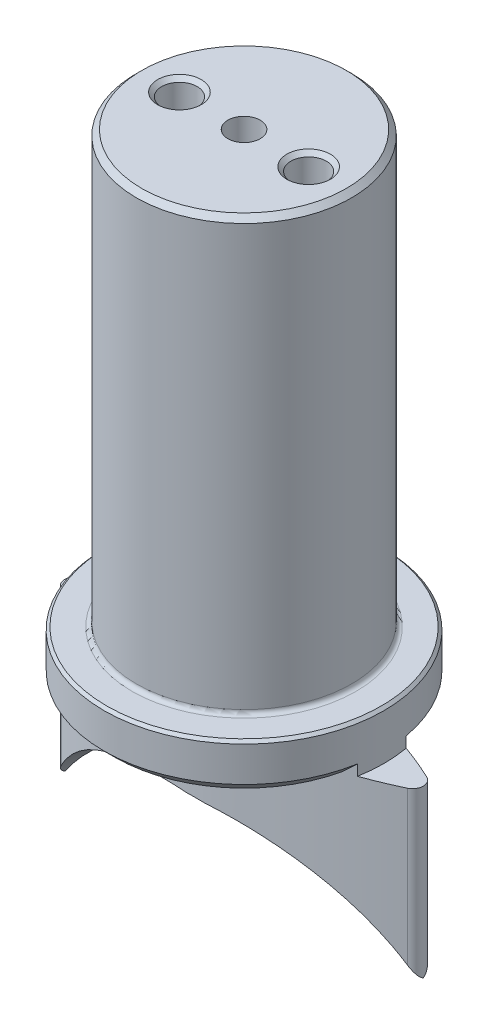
ISO-10303-21;
HEADER;
FILE_DESCRIPTION(('STEP AP214'),'2;1');
FILE_NAME('part.step','',(''),(''),'','','');
FILE_SCHEMA(('AUTOMOTIVE_DESIGN { 1 0 10303 214 1 1 1 1 }'));
ENDSEC;
DATA;
#1=APPLICATION_CONTEXT('core data for automotive mechanical design processes');
#2=APPLICATION_PROTOCOL_DEFINITION('international standard','automotive_design',2000,#1);
#3=PRODUCT_CONTEXT('',#1,'mechanical');
#4=PRODUCT('Part','Part','',(#3));
#5=PRODUCT_RELATED_PRODUCT_CATEGORY('part','',(#4));
#6=PRODUCT_DEFINITION_FORMATION('','',#4);
#7=PRODUCT_DEFINITION_CONTEXT('part definition',#1,'design');
#8=PRODUCT_DEFINITION('design','',#6,#7);
#9=PRODUCT_DEFINITION_SHAPE('','',#8);
#10=(LENGTH_UNIT() NAMED_UNIT(*) SI_UNIT(.MILLI.,.METRE.));
#11=(NAMED_UNIT(*) PLANE_ANGLE_UNIT() SI_UNIT($,.RADIAN.));
#12=(NAMED_UNIT(*) SI_UNIT($,.STERADIAN.) SOLID_ANGLE_UNIT());
#13=UNCERTAINTY_MEASURE_WITH_UNIT(LENGTH_MEASURE(1.E-05),#10,'distance_accuracy_value','');
#14=(GEOMETRIC_REPRESENTATION_CONTEXT(3) GLOBAL_UNCERTAINTY_ASSIGNED_CONTEXT((#13)) GLOBAL_UNIT_ASSIGNED_CONTEXT((#10,
#11,#12)) REPRESENTATION_CONTEXT('',''));
#15=CARTESIAN_POINT('',(0.,0.,0.));
#16=DIRECTION('',(0.,0.,1.));
#17=DIRECTION('',(1.,0.,0.));
#18=AXIS2_PLACEMENT_3D('',#15,#16,#17);
#19=CARTESIAN_POINT('',(-9.99999999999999,-8.50000000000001,-10000.));
#20=DIRECTION('',(0.,-1.,0.));
#21=DIRECTION('',(1.,0.,0.));
#22=AXIS2_PLACEMENT_3D('',#19,#20,#21);
#23=PLANE('',#22);
#24=CARTESIAN_POINT('',(0.,-8.50000000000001,0.));
#25=DIRECTION('',(0.,1.,0.));
#26=DIRECTION('',(0.,0.,1.));
#27=AXIS2_PLACEMENT_3D('',#24,#25,#26);
#28=CIRCLE('',#27,13.);
#29=CARTESIAN_POINT('',(-12.8021501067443,-8.50000000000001,-2.25941422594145));
#30=VERTEX_POINT('',#29);
#31=CARTESIAN_POINT('',(-12.8021501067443,-8.50000000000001,2.25941422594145));
#32=VERTEX_POINT('',#31);
#33=EDGE_CURVE('E462',#30,#32,#28,.T.);
#34=ORIENTED_EDGE('',*,*,#33,.F.);
#35=CARTESIAN_POINT('',(0.,-8.5,33.1944444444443));
#36=DIRECTION('',(0.,-1.,0.));
#37=DIRECTION('',(1.,0.,0.));
#38=AXIS2_PLACEMENT_3D('',#35,#36,#37);
#39=CIRCLE('',#38,37.6944444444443);
#40=CARTESIAN_POINT('',(-16.0662721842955,-8.50000000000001,-0.904617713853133));
#41=VERTEX_POINT('',#40);
#42=EDGE_CURVE('E461',#41,#30,#39,.T.);
#43=ORIENTED_EDGE('',*,*,#42,.F.);
#44=CARTESIAN_POINT('',(-15.6400483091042,-8.50000000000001,0.));
#45=DIRECTION('',(0.,-1.,0.));
#46=DIRECTION('',(1.,0.,0.));
#47=AXIS2_PLACEMENT_3D('',#44,#45,#46);
#48=CIRCLE('',#47,1.);
#49=CARTESIAN_POINT('',(-16.0662721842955,-8.50000000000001,0.904617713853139));
#50=VERTEX_POINT('',#49);
#51=EDGE_CURVE('E387',#41,#50,#48,.F.);
#52=ORIENTED_EDGE('',*,*,#51,.T.);
#53=CARTESIAN_POINT('',(0.,-8.5,-33.1944444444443));
#54=DIRECTION('',(0.,-1.,0.));
#55=DIRECTION('',(1.,0.,0.));
#56=AXIS2_PLACEMENT_3D('',#53,#54,#55);
#57=CIRCLE('',#56,37.6944444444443);
#58=EDGE_CURVE('E466',#50,#32,#57,.F.);
#59=ORIENTED_EDGE('',*,*,#58,.T.);
#60=EDGE_LOOP('',(#34,#43,#52,#59));
#61=FACE_BOUND('',#60,.T.);
#62=ADVANCED_FACE('F35',(#61),#23,.F.);
#63=CARTESIAN_POINT('',(18.7833671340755,-8.5,-10000.));
#64=DIRECTION('',(0.,-1.,0.));
#65=DIRECTION('',(1.,0.,0.));
#66=AXIS2_PLACEMENT_3D('',#63,#64,#65);
#67=PLANE('',#66);
#68=CARTESIAN_POINT('',(12.8021501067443,-8.50000000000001,2.25941422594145));
#69=VERTEX_POINT('',#68);
#70=CARTESIAN_POINT('',(12.8021501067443,-8.50000000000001,-2.25941422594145));
#71=VERTEX_POINT('',#70);
#72=EDGE_CURVE('E457',#69,#71,#28,.T.);
#73=ORIENTED_EDGE('',*,*,#72,.F.);
#74=CARTESIAN_POINT('',(0.,-8.50000000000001,-33.1944444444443));
#75=DIRECTION('',(0.,-1.,0.));
#76=DIRECTION('',(1.,0.,0.));
#77=AXIS2_PLACEMENT_3D('',#74,#75,#76);
#78=CIRCLE('',#77,37.6944444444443);
#79=CARTESIAN_POINT('',(16.0662721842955,-8.5,0.90461771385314));
#80=VERTEX_POINT('',#79);
#81=EDGE_CURVE('E450',#69,#80,#78,.F.);
#82=ORIENTED_EDGE('',*,*,#81,.T.);
#83=CARTESIAN_POINT('',(15.6400483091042,-8.5,0.));
#84=DIRECTION('',(0.,-1.,0.));
#85=DIRECTION('',(1.,0.,0.));
#86=AXIS2_PLACEMENT_3D('',#83,#84,#85);
#87=CIRCLE('',#86,1.);
#88=CARTESIAN_POINT('',(16.0662721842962,-8.5,-0.904617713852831));
#89=VERTEX_POINT('',#88);
#90=EDGE_CURVE('E414',#80,#89,#87,.F.);
#91=ORIENTED_EDGE('',*,*,#90,.T.);
#92=CARTESIAN_POINT('',(0.,-8.50000000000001,33.1944444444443));
#93=DIRECTION('',(0.,-1.,0.));
#94=DIRECTION('',(1.,0.,0.));
#95=AXIS2_PLACEMENT_3D('',#92,#93,#94);
#96=CIRCLE('',#95,37.6944444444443);
#97=EDGE_CURVE('E451',#71,#89,#96,.T.);
#98=ORIENTED_EDGE('',*,*,#97,.F.);
#99=EDGE_LOOP('',(#73,#82,#91,#98));
#100=FACE_BOUND('',#99,.T.);
#101=ADVANCED_FACE('F198',(#100),#67,.F.);
#102=CARTESIAN_POINT('',(0.,-25.,-33.1944444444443));
#103=DIRECTION('',(0.,1.,0.));
#104=DIRECTION('',(0.,0.,1.));
#105=AXIS2_PLACEMENT_3D('',#102,#103,#104);
#106=CYLINDRICAL_SURFACE('',#105,37.6944444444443);
#107=CARTESIAN_POINT('',(-11.7069036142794,-8.50000000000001,2.63598326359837));
#108=VERTEX_POINT('',#107);
#109=CARTESIAN_POINT('',(11.7069036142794,-8.5,2.63598326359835));
#110=VERTEX_POINT('',#109);
#111=EDGE_CURVE('E470',#108,#110,#78,.F.);
#112=ORIENTED_EDGE('',*,*,#111,.F.);
#113=CARTESIAN_POINT('',(-11.7069036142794,-8.50000000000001,2.63598326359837));
#114=CARTESIAN_POINT('',(-11.890774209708,-8.33378062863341,2.57590065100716));
#115=CARTESIAN_POINT('',(-12.0739800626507,-8.16733759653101,2.51447858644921));
#116=CARTESIAN_POINT('',(-12.4390622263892,-7.83400426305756,2.38895557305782));
#117=CARTESIAN_POINT('',(-12.6209385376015,-7.66711396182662,2.32485462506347));
#118=CARTESIAN_POINT('',(-12.8021501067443,-7.49999999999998,2.25941422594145));
#119=B_SPLINE_CURVE_WITH_KNOTS('',3,(#113,#114,#115,#116,#117,#118),.UNSPECIFIED.,.F.,.F.,(4,2,
4),(0.,0.765090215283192,1.53018019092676),.UNSPECIFIED.);
#120=CARTESIAN_POINT('',(-12.8021501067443,-7.49999999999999,2.25941422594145));
#121=VERTEX_POINT('',#120);
#122=EDGE_CURVE('E227',#108,#121,#119,.T.);
#123=ORIENTED_EDGE('',*,*,#122,.T.);
#124=DIRECTION('',(0.,-1.,0.));
#125=VECTOR('',#124,1.);
#126=CARTESIAN_POINT('',(-12.8021501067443,-8.50000000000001,2.25941422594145));
#127=LINE('',#126,#125);
#128=EDGE_CURVE('E431',#32,#121,#127,.F.);
#129=ORIENTED_EDGE('',*,*,#128,.F.);
#130=ORIENTED_EDGE('',*,*,#58,.F.);
#131=DIRECTION('',(0.,1.,0.));
#132=VECTOR('',#131,1.);
#133=CARTESIAN_POINT('',(-16.0662721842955,-25.,0.90461771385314));
#134=LINE('',#133,#132);
#135=CARTESIAN_POINT('',(-16.0662721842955,-22.715313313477,0.904617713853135));
#136=VERTEX_POINT('',#135);
#137=EDGE_CURVE('E179',#50,#136,#134,.F.);
#138=ORIENTED_EDGE('',*,*,#137,.T.);
#139=CARTESIAN_POINT('',(-0.705145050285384,-15.5250426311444,4.49340389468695));
#140=CARTESIAN_POINT('',(-0.948235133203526,-15.5131473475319,4.48885767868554));
#141=CARTESIAN_POINT('',(-1.19146379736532,-15.5054483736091,4.48195133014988));
#142=CARTESIAN_POINT('',(-1.67787535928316,-15.4986198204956,4.46342463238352));
#143=CARTESIAN_POINT('',(-1.9210582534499,-15.4994907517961,4.45180400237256));
#144=CARTESIAN_POINT('',(-2.65005177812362,-15.5152258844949,4.40987893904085));
#145=CARTESIAN_POINT('',(-3.13526566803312,-15.5432145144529,4.37251211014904));
#146=CARTESIAN_POINT('',(-4.10010014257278,-15.6352347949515,4.27948152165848));
#147=CARTESIAN_POINT('',(-4.5797245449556,-15.6992401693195,4.22383111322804));
#148=CARTESIAN_POINT('',(-5.5302412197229,-15.863906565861,4.09519899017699));
#149=CARTESIAN_POINT('',(-6.00113469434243,-15.9645625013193,4.02221968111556));
#150=CARTESIAN_POINT('',(-6.93180292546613,-16.2029652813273,3.86017587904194));
#151=CARTESIAN_POINT('',(-7.39154946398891,-16.3407973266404,3.77107459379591));
#152=CARTESIAN_POINT('',(-8.29541797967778,-16.6531033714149,3.57878901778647));
#153=CARTESIAN_POINT('',(-8.73953903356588,-16.827579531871,3.47560389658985));
#154=CARTESIAN_POINT('',(-9.60872410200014,-17.2122128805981,3.25749985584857));
#155=CARTESIAN_POINT('',(-10.0337988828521,-17.4223495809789,3.14258768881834));
#156=CARTESIAN_POINT('',(-10.8623457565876,-17.8770880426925,2.90356816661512));
#157=CARTESIAN_POINT('',(-11.265818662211,-18.1216885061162,2.77946115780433));
#158=CARTESIAN_POINT('',(-12.0413337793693,-18.6387670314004,2.52726538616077));
#159=CARTESIAN_POINT('',(-12.4138271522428,-18.9106279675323,2.39929688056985));
#160=CARTESIAN_POINT('',(-13.13384770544,-19.4841698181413,2.1399530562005));
#161=CARTESIAN_POINT('',(-13.4813734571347,-19.7858524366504,2.00857754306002));
#162=CARTESIAN_POINT('',(-14.1499657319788,-20.4171283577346,1.74520005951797));
#163=CARTESIAN_POINT('',(-14.471026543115,-20.7467276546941,1.6131979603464));
#164=CARTESIAN_POINT('',(-15.0852683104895,-21.4315561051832,1.35142785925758));
#165=CARTESIAN_POINT('',(-15.3784556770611,-21.7867793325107,1.22165934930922));
#166=CARTESIAN_POINT('',(-15.9940831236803,-22.5971684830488,0.940545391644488));
#167=CARTESIAN_POINT('',(-16.309943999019,-23.0577647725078,0.790319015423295));
#168=CARTESIAN_POINT('',(-16.7507511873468,-23.7706386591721,0.574034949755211));
#169=CARTESIAN_POINT('',(-16.8920477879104,-24.0116405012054,0.503524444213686));
#170=CARTESIAN_POINT('',(-17.1637186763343,-24.5006623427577,0.365964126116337));
#171=CARTESIAN_POINT('',(-17.2940937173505,-24.7486818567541,0.298914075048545));
#172=CARTESIAN_POINT('',(-17.4189738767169,-25.,0.23384434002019));
#173=B_SPLINE_CURVE_WITH_KNOTS('',3,(#139,#140,#141,#142,#143,#144,#145,#146,#147,#148,#149,
#150,#151,#152,#153,#154,#155,#156,#157,#158,#159,#160,#161,#162,#163,#164,#165,#166,#167,#168,
#169,#170,#171,#172),.UNSPECIFIED.,.F.,.F.,(4,2,2,2,2,2,2,2,2,2,2,2,2,2,2,2,4),(0.,
0.730173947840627,1.46039139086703,2.92095083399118,4.38044609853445,5.83973887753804,
7.30240492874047,8.76515726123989,10.227072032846,11.6889317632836,13.1230495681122,
14.5572493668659,15.9917579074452,17.4259357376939,19.1581022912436,20.0222257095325,
20.8862894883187),.UNSPECIFIED.);
#174=CARTESIAN_POINT('',(-0.837671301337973,-15.5189744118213,4.49069120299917));
#175=VERTEX_POINT('',#174);
#176=EDGE_CURVE('E176',#175,#136,#173,.T.);
#177=ORIENTED_EDGE('',*,*,#176,.F.);
#178=CARTESIAN_POINT('',(-0.849473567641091,-15.5195131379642,4.49042701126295));
#179=CARTESIAN_POINT('',(-0.566315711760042,-15.5065043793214,4.49680900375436));
#180=CARTESIAN_POINT('',(-0.283157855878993,-15.5,4.50000000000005));
#181=CARTESIAN_POINT('',(0.283157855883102,-15.5000000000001,4.50000000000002));
#182=CARTESIAN_POINT('',(0.566315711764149,-15.5065043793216,4.49680900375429));
#183=CARTESIAN_POINT('',(0.849473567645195,-15.5195131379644,4.49042701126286));
#184=B_SPLINE_CURVE_WITH_KNOTS('',3,(#178,#179,#180,#181,#182,#183),.UNSPECIFIED.,.F.,.F.,(4,2,
4),(0.,0.849751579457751,1.6995031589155),.UNSPECIFIED.);
#185=CARTESIAN_POINT('',(0.837671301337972,-15.5189744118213,4.49069120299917));
#186=VERTEX_POINT('',#185);
#187=EDGE_CURVE('E208',#175,#186,#184,.T.);
#188=ORIENTED_EDGE('',*,*,#187,.T.);
#189=CARTESIAN_POINT('',(0.70514505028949,-15.5250426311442,4.49340389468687));
#190=CARTESIAN_POINT('',(0.948235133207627,-15.5131473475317,4.48885767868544));
#191=CARTESIAN_POINT('',(1.19146379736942,-15.5054483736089,4.48195133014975));
#192=CARTESIAN_POINT('',(1.67787535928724,-15.4986198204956,4.46342463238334));
#193=CARTESIAN_POINT('',(1.92105825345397,-15.4994907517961,4.45180400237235));
#194=CARTESIAN_POINT('',(2.65005177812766,-15.5152258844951,4.40987893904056));
#195=CARTESIAN_POINT('',(3.13526566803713,-15.5432145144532,4.3725121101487));
#196=CARTESIAN_POINT('',(4.10010014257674,-15.635234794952,4.27948152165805));
#197=CARTESIAN_POINT('',(4.57972454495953,-15.6992401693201,4.22383111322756));
#198=CARTESIAN_POINT('',(5.53024121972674,-15.8639065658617,4.09519899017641));
#199=CARTESIAN_POINT('',(6.00113469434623,-15.9645625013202,4.02221968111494));
#200=CARTESIAN_POINT('',(6.93180292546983,-16.2029652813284,3.86017587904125));
#201=CARTESIAN_POINT('',(7.39154946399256,-16.3407973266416,3.77107459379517));
#202=CARTESIAN_POINT('',(8.29541797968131,-16.6531033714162,3.57878901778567));
#203=CARTESIAN_POINT('',(8.73953903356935,-16.8275795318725,3.47560389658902));
#204=CARTESIAN_POINT('',(9.60872410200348,-17.2122128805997,3.25749985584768));
#205=CARTESIAN_POINT('',(10.0337988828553,-17.4223495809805,3.14258768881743));
#206=CARTESIAN_POINT('',(10.8623457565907,-17.8770880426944,2.90356816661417));
#207=CARTESIAN_POINT('',(11.265818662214,-18.1216885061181,2.77946115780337));
#208=CARTESIAN_POINT('',(12.0413337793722,-18.6387670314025,2.52726538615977));
#209=CARTESIAN_POINT('',(12.4138271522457,-18.9106279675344,2.39929688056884));
#210=CARTESIAN_POINT('',(13.1338477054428,-19.4841698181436,2.13995305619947));
#211=CARTESIAN_POINT('',(13.4813734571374,-19.7858524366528,2.00857754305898));
#212=CARTESIAN_POINT('',(14.1499657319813,-20.4171283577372,1.74520005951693));
#213=CARTESIAN_POINT('',(14.4710265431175,-20.7467276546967,1.61319796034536));
#214=CARTESIAN_POINT('',(15.0852683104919,-21.4315561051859,1.35142785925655));
#215=CARTESIAN_POINT('',(15.3784556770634,-21.7867793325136,1.2216593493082));
#216=CARTESIAN_POINT('',(15.994083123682,-22.5971684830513,0.940545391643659));
#217=CARTESIAN_POINT('',(16.3099439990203,-23.0577647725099,0.790319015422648));
#218=CARTESIAN_POINT('',(16.7507511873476,-23.7706386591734,0.57403494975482));
#219=CARTESIAN_POINT('',(16.892047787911,-24.0116405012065,0.503524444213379));
#220=CARTESIAN_POINT('',(17.1637186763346,-24.5006623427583,0.365964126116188));
#221=CARTESIAN_POINT('',(17.2940937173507,-24.7486818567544,0.298914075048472));
#222=CARTESIAN_POINT('',(17.4189738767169,-25.,0.233844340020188));
#223=B_SPLINE_CURVE_WITH_KNOTS('',3,(#189,#190,#191,#192,#193,#194,#195,#196,#197,#198,#199,
#200,#201,#202,#203,#204,#205,#206,#207,#208,#209,#210,#211,#212,#213,#214,#215,#216,#217,#218,
#219,#220,#221,#222),.UNSPECIFIED.,.F.,.F.,(4,2,2,2,2,2,2,2,2,2,2,2,2,2,2,2,4),(0.,
0.730173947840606,1.46039139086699,2.9209508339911,4.38044609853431,5.83973887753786,
7.30240492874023,8.7651572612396,10.2270720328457,11.6889317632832,13.1230495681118,
14.5572493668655,15.9917579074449,17.4259357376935,19.1581022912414,20.0222257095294,
20.8862894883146),.UNSPECIFIED.);
#224=CARTESIAN_POINT('',(16.0662721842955,-22.7153133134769,0.904617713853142));
#225=VERTEX_POINT('',#224);
#226=EDGE_CURVE('E215',#186,#225,#223,.T.);
#227=ORIENTED_EDGE('',*,*,#226,.T.);
#228=DIRECTION('',(0.,1.,0.));
#229=VECTOR('',#228,1.);
#230=CARTESIAN_POINT('',(16.0662721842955,-25.,0.90461771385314));
#231=LINE('',#230,#229);
#232=EDGE_CURVE('E476',#225,#80,#231,.T.);
#233=ORIENTED_EDGE('',*,*,#232,.T.);
#234=ORIENTED_EDGE('',*,*,#81,.F.);
#235=DIRECTION('',(0.,-1.,0.));
#236=VECTOR('',#235,1.);
#237=CARTESIAN_POINT('',(12.8021501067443,-7.49999999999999,2.25941422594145));
#238=LINE('',#237,#236);
#239=CARTESIAN_POINT('',(12.8021501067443,-7.49999999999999,2.25941422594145));
#240=VERTEX_POINT('',#239);
#241=EDGE_CURVE('E437',#240,#69,#238,.T.);
#242=ORIENTED_EDGE('',*,*,#241,.F.);
#243=CARTESIAN_POINT('',(12.8021501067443,-7.49999999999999,2.25941422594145));
#244=CARTESIAN_POINT('',(12.6209385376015,-7.66711396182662,2.32485462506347));
#245=CARTESIAN_POINT('',(12.4390622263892,-7.83400426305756,2.38895557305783));
#246=CARTESIAN_POINT('',(12.0739800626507,-8.16733759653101,2.51447858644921));
#247=CARTESIAN_POINT('',(11.890774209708,-8.3337806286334,2.57590065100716));
#248=CARTESIAN_POINT('',(11.7069036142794,-8.50000000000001,2.63598326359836));
#249=B_SPLINE_CURVE_WITH_KNOTS('',3,(#243,#244,#245,#246,#247,#248),.UNSPECIFIED.,.F.,.F.,(4,2,
4),(0.,0.765089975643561,1.53018019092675),.UNSPECIFIED.);
#250=EDGE_CURVE('E221',#240,#110,#249,.T.);
#251=ORIENTED_EDGE('',*,*,#250,.T.);
#252=EDGE_LOOP('',(#112,#123,#129,#130,#138,#177,#188,#227,#233,#234,#242,#251));
#253=FACE_BOUND('',#252,.T.);
#254=ADVANCED_FACE('F193',(#253),#106,.T.);
#255=CARTESIAN_POINT('',(0.,-25.9985451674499,33.1944444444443));
#256=DIRECTION('',(0.,1.,0.));
#257=DIRECTION('',(0.,0.,1.));
#258=AXIS2_PLACEMENT_3D('',#255,#256,#257);
#259=CYLINDRICAL_SURFACE('',#258,37.6944444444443);
#260=ORIENTED_EDGE('',*,*,#42,.T.);
#261=DIRECTION('',(0.,1.,0.));
#262=VECTOR('',#261,1.);
#263=CARTESIAN_POINT('',(-12.8021501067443,-7.49999999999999,-2.25941422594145));
#264=LINE('',#263,#262);
#265=CARTESIAN_POINT('',(-12.8021501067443,-7.49999999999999,-2.25941422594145));
#266=VERTEX_POINT('',#265);
#267=EDGE_CURVE('E429',#266,#30,#264,.F.);
#268=ORIENTED_EDGE('',*,*,#267,.F.);
#269=CARTESIAN_POINT('',(-12.8021501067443,-7.49999999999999,-2.25941422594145));
#270=CARTESIAN_POINT('',(-12.6209385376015,-7.66711396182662,-2.32485462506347));
#271=CARTESIAN_POINT('',(-12.4390622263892,-7.83400426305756,-2.38895557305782));
#272=CARTESIAN_POINT('',(-12.0739800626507,-8.16733759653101,-2.51447858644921));
#273=CARTESIAN_POINT('',(-11.890774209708,-8.3337806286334,-2.57590065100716));
#274=CARTESIAN_POINT('',(-11.7069036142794,-8.50000000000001,-2.63598326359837));
#275=B_SPLINE_CURVE_WITH_KNOTS('',3,(#269,#270,#271,#272,#273,#274),.UNSPECIFIED.,.F.,.F.,(4,2,
4),(0.,0.765089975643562,1.53018019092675),.UNSPECIFIED.);
#276=CARTESIAN_POINT('',(-11.7069036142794,-8.50000000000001,-2.63598326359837));
#277=VERTEX_POINT('',#276);
#278=EDGE_CURVE('E247',#266,#277,#275,.T.);
#279=ORIENTED_EDGE('',*,*,#278,.T.);
#280=CARTESIAN_POINT('',(11.7069036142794,-8.5,-2.63598326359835));
#281=VERTEX_POINT('',#280);
#282=EDGE_CURVE('E446',#277,#281,#96,.T.);
#283=ORIENTED_EDGE('',*,*,#282,.T.);
#284=CARTESIAN_POINT('',(11.7069036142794,-8.5,-2.63598326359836));
#285=CARTESIAN_POINT('',(11.890774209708,-8.3337806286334,-2.57590065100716));
#286=CARTESIAN_POINT('',(12.0739800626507,-8.16733759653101,-2.51447858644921));
#287=CARTESIAN_POINT('',(12.4390622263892,-7.83400426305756,-2.38895557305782));
#288=CARTESIAN_POINT('',(12.6209385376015,-7.66711396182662,-2.32485462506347));
#289=CARTESIAN_POINT('',(12.8021501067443,-7.49999999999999,-2.25941422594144));
#290=B_SPLINE_CURVE_WITH_KNOTS('',3,(#284,#285,#286,#287,#288,#289),.UNSPECIFIED.,.F.,.F.,(4,2,
4),(0.,0.765090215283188,1.53018019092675),.UNSPECIFIED.);
#291=CARTESIAN_POINT('',(12.8021501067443,-7.49999999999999,-2.25941422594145));
#292=VERTEX_POINT('',#291);
#293=EDGE_CURVE('E252',#281,#292,#290,.T.);
#294=ORIENTED_EDGE('',*,*,#293,.T.);
#295=DIRECTION('',(0.,1.,0.));
#296=VECTOR('',#295,1.);
#297=CARTESIAN_POINT('',(12.8021501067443,-8.50000000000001,-2.25941422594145));
#298=LINE('',#297,#296);
#299=EDGE_CURVE('E58',#71,#292,#298,.T.);
#300=ORIENTED_EDGE('',*,*,#299,.F.);
#301=ORIENTED_EDGE('',*,*,#97,.T.);
#302=DIRECTION('',(0.,1.,0.));
#303=VECTOR('',#302,1.);
#304=CARTESIAN_POINT('',(16.0662721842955,-25.9985451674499,-0.904617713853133));
#305=LINE('',#304,#303);
#306=CARTESIAN_POINT('',(16.0662721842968,-22.7153133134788,-0.904617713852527));
#307=VERTEX_POINT('',#306);
#308=EDGE_CURVE('E477',#89,#307,#305,.F.);
#309=ORIENTED_EDGE('',*,*,#308,.T.);
#310=CARTESIAN_POINT('',(17.4189738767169,-25.,-0.233844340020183));
#311=CARTESIAN_POINT('',(17.1987440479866,-24.5567028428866,-0.348581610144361));
#312=CARTESIAN_POINT('',(16.9612825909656,-24.1235745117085,-0.469573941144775));
#313=CARTESIAN_POINT('',(16.4527085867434,-23.2803564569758,-0.72104413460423));
#314=CARTESIAN_POINT('',(16.1815911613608,-22.8702700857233,-0.851523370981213));
#315=CARTESIAN_POINT('',(15.6060570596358,-22.0752423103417,-1.11915172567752));
#316=CARTESIAN_POINT('',(15.3015805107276,-21.6903481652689,-1.25631258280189));
#317=CARTESIAN_POINT('',(14.6608886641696,-20.94920893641,-1.53380552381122));
#318=CARTESIAN_POINT('',(14.3246753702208,-20.5929620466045,-1.67413740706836));
#319=CARTESIAN_POINT('',(13.6212833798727,-19.9110282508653,-1.95488539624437));
#320=CARTESIAN_POINT('',(13.2540494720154,-19.5853981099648,-2.09530119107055));
#321=CARTESIAN_POINT('',(12.4909611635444,-18.9678420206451,-2.3725597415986));
#322=CARTESIAN_POINT('',(12.0951060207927,-18.675916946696,-2.50940240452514));
#323=CARTESIAN_POINT('',(11.2776135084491,-18.1283456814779,-2.77597570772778));
#324=CARTESIAN_POINT('',(10.8560116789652,-17.8726510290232,-2.90571570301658));
#325=CARTESIAN_POINT('',(9.98931395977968,-17.3989531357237,-3.1550811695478));
#326=CARTESIAN_POINT('',(9.54421973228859,-17.1809472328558,-3.27470735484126));
#327=CARTESIAN_POINT('',(8.65171105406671,-16.7918796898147,-3.49645441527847));
#328=CARTESIAN_POINT('',(8.20508057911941,-16.6193055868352,-3.599079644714));
#329=CARTESIAN_POINT('',(7.29626654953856,-16.3110479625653,-3.79002822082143));
#330=CARTESIAN_POINT('',(6.8340820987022,-16.1753665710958,-3.87835074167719));
#331=CARTESIAN_POINT('',(5.89762037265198,-15.9412272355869,-4.0388053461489));
#332=CARTESIAN_POINT('',(5.42334261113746,-15.8427707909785,-4.11093677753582));
#333=CARTESIAN_POINT('',(4.46645489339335,-15.6829156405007,-4.2375577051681));
#334=CARTESIAN_POINT('',(3.9838477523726,-15.621504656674,-4.29205304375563));
#335=CARTESIAN_POINT('',(3.03504380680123,-15.5369056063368,-4.38050085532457));
#336=CARTESIAN_POINT('',(2.56906148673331,-15.5121518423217,-4.41525304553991));
#337=CARTESIAN_POINT('',(1.86965897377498,-15.4991837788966,-4.45432632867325));
#338=CARTESIAN_POINT('',(1.63674835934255,-15.4988733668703,-4.46516941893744));
#339=CARTESIAN_POINT('',(1.17089729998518,-15.5061067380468,-4.48253103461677));
#340=CARTESIAN_POINT('',(0.937956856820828,-15.5136501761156,-4.48904975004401));
#341=CARTESIAN_POINT('',(0.705145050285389,-15.5250426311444,-4.49340389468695));
#342=B_SPLINE_CURVE_WITH_KNOTS('',3,(#310,#311,#312,#313,#314,#315,#316,#317,#318,#319,#320,
#321,#322,#323,#324,#325,#326,#327,#328,#329,#330,#331,#332,#333,#334,#335,#336,#337,#338,#339,
#340,#341),.UNSPECIFIED.,.F.,.F.,(4,2,2,2,2,2,2,2,2,2,2,2,2,2,2,4),(0.,1.52392622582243,
3.0480735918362,4.57500273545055,6.1018355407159,7.63144554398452,9.16109522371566,
10.6886791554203,12.2161551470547,13.6833827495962,15.150695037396,16.6180664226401,
18.084951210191,19.48716875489,20.1865094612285,20.8858194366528),.UNSPECIFIED.);
#343=CARTESIAN_POINT('',(0.837671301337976,-15.5189744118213,-4.49069120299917));
#344=VERTEX_POINT('',#343);
#345=EDGE_CURVE('E472',#307,#344,#342,.T.);
#346=ORIENTED_EDGE('',*,*,#345,.T.);
#347=CARTESIAN_POINT('',(-0.849473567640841,-15.5195131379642,-4.49042701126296));
#348=CARTESIAN_POINT('',(-0.566315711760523,-15.5065043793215,-4.49680900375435));
#349=CARTESIAN_POINT('',(-0.283157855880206,-15.5000000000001,-4.50000000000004));
#350=CARTESIAN_POINT('',(0.283157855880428,-15.5000000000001,-4.50000000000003));
#351=CARTESIAN_POINT('',(0.566315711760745,-15.5065043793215,-4.49680900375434));
#352=CARTESIAN_POINT('',(0.849473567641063,-15.5195131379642,-4.49042701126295));
#353=B_SPLINE_CURVE_WITH_KNOTS('',3,(#347,#348,#349,#350,#351,#352),.UNSPECIFIED.,.F.,.F.,(4,2,
4),(0.,0.849751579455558,1.69950315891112),.UNSPECIFIED.);
#354=CARTESIAN_POINT('',(-0.837671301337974,-15.5189744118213,-4.49069120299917));
#355=VERTEX_POINT('',#354);
#356=EDGE_CURVE('E505',#355,#344,#353,.T.);
#357=ORIENTED_EDGE('',*,*,#356,.F.);
#358=CARTESIAN_POINT('',(-17.4189738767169,-25.,-0.233844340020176));
#359=CARTESIAN_POINT('',(-17.1987440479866,-24.5567028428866,-0.348581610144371));
#360=CARTESIAN_POINT('',(-16.9612825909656,-24.1235745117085,-0.469573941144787));
#361=CARTESIAN_POINT('',(-16.4527085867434,-23.2803564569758,-0.721044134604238));
#362=CARTESIAN_POINT('',(-16.1815911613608,-22.8702700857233,-0.851523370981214));
#363=CARTESIAN_POINT('',(-15.6060570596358,-22.0752423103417,-1.11915172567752));
#364=CARTESIAN_POINT('',(-15.3015805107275,-21.6903481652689,-1.2563125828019));
#365=CARTESIAN_POINT('',(-14.6608886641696,-20.94920893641,-1.53380552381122));
#366=CARTESIAN_POINT('',(-14.3246753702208,-20.5929620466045,-1.67413740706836));
#367=CARTESIAN_POINT('',(-13.6212833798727,-19.9110282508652,-1.95488539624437));
#368=CARTESIAN_POINT('',(-13.2540494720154,-19.5853981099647,-2.09530119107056));
#369=CARTESIAN_POINT('',(-12.4909611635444,-18.967842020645,-2.3725597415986));
#370=CARTESIAN_POINT('',(-12.0951060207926,-18.675916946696,-2.50940240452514));
#371=CARTESIAN_POINT('',(-11.2776135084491,-18.1283456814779,-2.77597570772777));
#372=CARTESIAN_POINT('',(-10.8560116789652,-17.8726510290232,-2.90571570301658));
#373=CARTESIAN_POINT('',(-9.98931395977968,-17.3989531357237,-3.15508116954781));
#374=CARTESIAN_POINT('',(-9.54421973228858,-17.1809472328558,-3.27470735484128));
#375=CARTESIAN_POINT('',(-8.65171105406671,-16.7918796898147,-3.49645441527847));
#376=CARTESIAN_POINT('',(-8.2050805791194,-16.6193055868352,-3.599079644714));
#377=CARTESIAN_POINT('',(-7.29626654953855,-16.3110479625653,-3.79002822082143));
#378=CARTESIAN_POINT('',(-6.83408209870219,-16.1753665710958,-3.87835074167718));
#379=CARTESIAN_POINT('',(-5.89762037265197,-15.9412272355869,-4.0388053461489));
#380=CARTESIAN_POINT('',(-5.42334261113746,-15.8427707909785,-4.11093677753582));
#381=CARTESIAN_POINT('',(-4.46645489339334,-15.6829156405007,-4.23755770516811));
#382=CARTESIAN_POINT('',(-3.98384775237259,-15.621504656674,-4.29205304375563));
#383=CARTESIAN_POINT('',(-3.03504380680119,-15.5369056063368,-4.38050085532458));
#384=CARTESIAN_POINT('',(-2.56906148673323,-15.5121518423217,-4.41525304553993));
#385=CARTESIAN_POINT('',(-1.86965897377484,-15.4991837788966,-4.45432632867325));
#386=CARTESIAN_POINT('',(-1.63674835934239,-15.4988733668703,-4.46516941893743));
#387=CARTESIAN_POINT('',(-1.17089729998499,-15.5061067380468,-4.48253103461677));
#388=CARTESIAN_POINT('',(-0.937956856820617,-15.5136501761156,-4.48904975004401));
#389=CARTESIAN_POINT('',(-0.705145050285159,-15.5250426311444,-4.49340389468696));
#390=B_SPLINE_CURVE_WITH_KNOTS('',3,(#358,#359,#360,#361,#362,#363,#364,#365,#366,#367,#368,
#369,#370,#371,#372,#373,#374,#375,#376,#377,#378,#379,#380,#381,#382,#383,#384,#385,#386,#387,
#388,#389),.UNSPECIFIED.,.F.,.F.,(4,2,2,2,2,2,2,2,2,2,2,2,2,2,2,4),(0.,1.52392622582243,
3.04807359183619,4.57500273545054,6.1018355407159,7.63144554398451,9.16109522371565,
10.6886791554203,12.2161551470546,13.6833827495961,15.150695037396,16.6180664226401,
18.084951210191,19.4871687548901,20.1865094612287,20.885819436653),.UNSPECIFIED.);
#391=CARTESIAN_POINT('',(-16.0662721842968,-22.7153133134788,-0.904617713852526));
#392=VERTEX_POINT('',#391);
#393=EDGE_CURVE('E366',#392,#355,#390,.T.);
#394=ORIENTED_EDGE('',*,*,#393,.F.);
#395=DIRECTION('',(0.,1.,0.));
#396=VECTOR('',#395,1.);
#397=CARTESIAN_POINT('',(-16.0662721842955,-25.9985451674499,-0.904617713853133));
#398=LINE('',#397,#396);
#399=EDGE_CURVE('E480',#392,#41,#398,.T.);
#400=ORIENTED_EDGE('',*,*,#399,.T.);
#401=EDGE_LOOP('',(#260,#268,#279,#283,#294,#300,#301,#309,#346,#357,#394,#400));
#402=FACE_BOUND('',#401,.T.);
#403=ADVANCED_FACE('F197',(#402),#259,.T.);
#404=CARTESIAN_POINT('',(0.,-34.0000000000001,4.5));
#405=DIRECTION('',(0.,0.,-1.));
#406=DIRECTION('',(-1.,0.,0.));
#407=AXIS2_PLACEMENT_3D('',#404,#405,#406);
#408=CYLINDRICAL_SURFACE('',#407,18.5);
#409=CARTESIAN_POINT('',(0.,-34.,0.));
#410=DIRECTION('',(-0.983043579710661,0.,-0.183372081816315));
#411=DIRECTION('',(0.183372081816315,0.,-0.983043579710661));
#412=AXIS2_PLACEMENT_3D('',#409,#410,#411);
#413=ELLIPSE('',#412,100.887767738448,18.5);
#414=CARTESIAN_POINT('',(-0.275058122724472,-15.5020448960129,1.47456536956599));
#415=VERTEX_POINT('',#414);
#416=EDGE_CURVE('E499',#415,#175,#413,.F.);
#417=ORIENTED_EDGE('',*,*,#416,.F.);
#418=CARTESIAN_POINT('',(-0.847716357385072,-15.5194324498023,1.23748817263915));
#419=CARTESIAN_POINT('',(-0.812969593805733,-15.5178383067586,1.26129029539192));
#420=CARTESIAN_POINT('',(-0.777234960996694,-15.5162977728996,1.28361848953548));
#421=CARTESIAN_POINT('',(-0.704012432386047,-15.513364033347,1.32519468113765));
#422=CARTESIAN_POINT('',(-0.666524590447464,-15.5119708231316,1.34444277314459));
#423=CARTESIAN_POINT('',(-0.55187666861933,-15.5080761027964,1.3973174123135));
#424=CARTESIAN_POINT('',(-0.47242637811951,-15.505854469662,1.42614666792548));
#425=CARTESIAN_POINT('',(-0.309798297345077,-15.5024150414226,1.47007925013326));
#426=CARTESIAN_POINT('',(-0.226618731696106,-15.501197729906,1.48517596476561));
#427=CARTESIAN_POINT('',(-0.0588936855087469,-15.4999038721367,1.50120690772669));
#428=CARTESIAN_POINT('',(0.0256516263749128,-15.4998271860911,1.50214287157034));
#429=CARTESIAN_POINT('',(0.193556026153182,-15.5008221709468,1.48983774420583));
#430=CARTESIAN_POINT('',(0.276916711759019,-15.5018921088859,1.47661804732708));
#431=CARTESIAN_POINT('',(0.440217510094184,-15.5050582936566,1.43640761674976));
#432=CARTESIAN_POINT('',(0.520159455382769,-15.5071539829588,1.40942436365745));
#433=CARTESIAN_POINT('',(0.641103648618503,-15.5110593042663,1.35693861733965));
#434=CARTESIAN_POINT('',(0.684058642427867,-15.5126039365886,1.33579592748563));
#435=CARTESIAN_POINT('',(0.767669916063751,-15.5158869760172,1.28955818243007));
#436=CARTESIAN_POINT('',(0.808330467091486,-15.5176250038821,1.26447082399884));
#437=CARTESIAN_POINT('',(0.847716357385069,-15.5194324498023,1.23748817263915));
#438=B_SPLINE_CURVE_WITH_KNOTS('',3,(#418,#419,#420,#421,#422,#423,#424,#425,#426,#427,#428,
#429,#430,#431,#432,#433,#434,#435,#436,#437),.UNSPECIFIED.,.F.,.F.,(4,2,2,2,2,2,2,2,2,4),(0.,
0.126365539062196,0.252727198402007,0.505070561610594,0.75753535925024,1.00996921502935,
1.26202208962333,1.51393811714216,1.65744533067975,1.80067593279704),.UNSPECIFIED.);
#439=CARTESIAN_POINT('',(0.275058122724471,-15.5020448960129,1.47456536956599));
#440=VERTEX_POINT('',#439);
#441=EDGE_CURVE('E170',#415,#440,#438,.T.);
#442=ORIENTED_EDGE('',*,*,#441,.T.);
#443=CARTESIAN_POINT('',(0.,-34.,0.));
#444=DIRECTION('',(0.983043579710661,0.,-0.183372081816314));
#445=DIRECTION('',(-0.183372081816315,0.,-0.983043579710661));
#446=AXIS2_PLACEMENT_3D('',#443,#444,#445);
#447=ELLIPSE('',#446,100.887767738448,18.5);
#448=EDGE_CURVE('E169',#440,#186,#447,.T.);
#449=ORIENTED_EDGE('',*,*,#448,.T.);
#450=ORIENTED_EDGE('',*,*,#187,.F.);
#451=EDGE_LOOP('',(#417,#442,#449,#450));
#452=FACE_BOUND('',#451,.T.);
#453=ADVANCED_FACE('F514',(#452),#408,.F.);
#454=CARTESIAN_POINT('',(-3.834752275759,-34.,-9.92124765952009));
#455=DIRECTION('',(0.360525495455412,0.,0.932749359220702));
#456=DIRECTION('',(0.932749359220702,0.,-0.360525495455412));
#457=AXIS2_PLACEMENT_3D('',#454,#455,#456);
#458=CYLINDRICAL_SURFACE('',#457,18.5);
#459=ORIENTED_EDGE('',*,*,#448,.F.);
#460=CARTESIAN_POINT('',(-0.47135690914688,-15.5245651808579,1.42401638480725));
#461=CARTESIAN_POINT('',(-0.431346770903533,-15.5228862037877,1.43725956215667));
#462=CARTESIAN_POINT('',(-0.390796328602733,-15.5212364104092,1.44881021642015));
#463=CARTESIAN_POINT('',(-0.308865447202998,-15.5180390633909,1.46846135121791));
#464=CARTESIAN_POINT('',(-0.267485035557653,-15.5164915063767,1.47656194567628));
#465=CARTESIAN_POINT('',(-0.142595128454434,-15.5120722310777,1.49557316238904));
#466=CARTESIAN_POINT('',(-0.0582160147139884,-15.509418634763,1.50123312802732));
#467=CARTESIAN_POINT('',(0.110323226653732,-15.5049990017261,1.49831431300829));
#468=CARTESIAN_POINT('',(0.194483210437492,-15.5032334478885,1.48972779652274));
#469=CARTESIAN_POINT('',(0.360175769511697,-15.5007890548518,1.45855194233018));
#470=CARTESIAN_POINT('',(0.441708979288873,-15.5001099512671,1.43596601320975));
#471=CARTESIAN_POINT('',(0.599662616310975,-15.4999150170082,1.37749186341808));
#472=CARTESIAN_POINT('',(0.676093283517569,-15.500396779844,1.34163129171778));
#473=CARTESIAN_POINT('',(0.821870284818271,-15.5024643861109,1.25761959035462));
#474=CARTESIAN_POINT('',(0.891215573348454,-15.5040503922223,1.20946665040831));
#475=CARTESIAN_POINT('',(1.02082400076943,-15.5081479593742,1.10226531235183));
#476=CARTESIAN_POINT('',(1.08109037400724,-15.5106591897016,1.04322081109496));
#477=CARTESIAN_POINT('',(1.19087961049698,-15.5163261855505,0.915899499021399));
#478=CARTESIAN_POINT('',(1.24040259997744,-15.5194819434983,0.847622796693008));
#479=CARTESIAN_POINT('',(1.32744529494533,-15.5260947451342,0.703556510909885));
#480=CARTESIAN_POINT('',(1.36493111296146,-15.5295526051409,0.627746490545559));
#481=CARTESIAN_POINT('',(1.42665586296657,-15.5363736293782,0.47090821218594));
#482=CARTESIAN_POINT('',(1.4508948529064,-15.5397367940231,0.389879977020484));
#483=CARTESIAN_POINT('',(1.48546783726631,-15.5459949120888,0.224753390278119));
#484=CARTESIAN_POINT('',(1.49577849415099,-15.5488890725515,0.140650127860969));
#485=CARTESIAN_POINT('',(1.50211004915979,-15.5538741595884,-0.0281144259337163));
#486=CARTESIAN_POINT('',(1.49813466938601,-15.5559652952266,-0.112775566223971));
#487=CARTESIAN_POINT('',(1.47841078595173,-15.558765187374,-0.26207070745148));
#488=CARTESIAN_POINT('',(1.46539475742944,-15.5596751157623,-0.327075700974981));
#489=CARTESIAN_POINT('',(1.43093601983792,-15.5608022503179,-0.454760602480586));
#490=CARTESIAN_POINT('',(1.40950022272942,-15.56102002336,-0.517442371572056));
#491=CARTESIAN_POINT('',(1.38398019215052,-15.5608664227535,-0.578445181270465));
#492=B_SPLINE_CURVE_WITH_KNOTS('',3,(#460,#461,#462,#463,#464,#465,#466,#467,#468,#469,#470,
#471,#472,#473,#474,#475,#476,#477,#478,#479,#480,#481,#482,#483,#484,#485,#486,#487,#488,#489,
#490,#491),.UNSPECIFIED.,.F.,.F.,(4,2,2,2,2,2,2,2,2,2,2,2,2,2,2,4),(0.,0.126457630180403,
0.252911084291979,0.505440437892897,0.758106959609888,1.0107119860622,1.26279380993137,
1.51491277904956,1.76694171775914,2.01896769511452,2.27169708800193,2.52442537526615,
2.77757659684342,3.03066186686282,3.22900558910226,3.4271868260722),.UNSPECIFIED.);
#493=CARTESIAN_POINT('',(1.5,-15.552982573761,0.));
#494=VERTEX_POINT('',#493);
#495=EDGE_CURVE('E155',#440,#494,#492,.T.);
#496=ORIENTED_EDGE('',*,*,#495,.T.);
#497=CARTESIAN_POINT('',(0.,-34.,0.));
#498=DIRECTION('',(0.,0.,1.));
#499=DIRECTION('',(1.,0.,0.));
#500=AXIS2_PLACEMENT_3D('',#497,#498,#499);
#501=ELLIPSE('',#500,19.8338383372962,18.5);
#502=CARTESIAN_POINT('',(16.6400483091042,-23.9327892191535,0.));
#503=VERTEX_POINT('',#502);
#504=EDGE_CURVE('E166',#503,#494,#501,.T.);
#505=ORIENTED_EDGE('',*,*,#504,.F.);
#506=CARTESIAN_POINT('',(16.6400483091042,-23.9327892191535,0.));
#507=CARTESIAN_POINT('',(16.6400365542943,-23.9161039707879,0.0299842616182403));
#508=CARTESIAN_POINT('',(16.6387003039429,-23.8980455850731,0.0591250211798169));
#509=CARTESIAN_POINT('',(16.6337459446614,-23.8598008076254,0.115640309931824));
#510=CARTESIAN_POINT('',(16.6301354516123,-23.8396217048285,0.143020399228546));
#511=CARTESIAN_POINT('',(16.6210523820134,-23.7978994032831,0.195800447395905));
#512=CARTESIAN_POINT('',(16.6156038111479,-23.7763765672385,0.22122098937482));
#513=CARTESIAN_POINT('',(16.6030868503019,-23.7320784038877,0.270564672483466));
#514=CARTESIAN_POINT('',(16.5960167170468,-23.7093017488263,0.2944861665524));
#515=CARTESIAN_POINT('',(16.5762594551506,-23.6502013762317,0.353459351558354));
#516=CARTESIAN_POINT('',(16.5626033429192,-23.613217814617,0.387527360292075));
#517=CARTESIAN_POINT('',(16.5325114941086,-23.5377044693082,0.452537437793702));
#518=CARTESIAN_POINT('',(16.5160751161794,-23.4991743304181,0.48347878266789));
#519=CARTESIAN_POINT('',(16.4628037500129,-23.3811318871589,0.572639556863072));
#520=CARTESIAN_POINT('',(16.4222683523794,-23.2999210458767,0.626475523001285));
#521=CARTESIAN_POINT('',(16.3552926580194,-23.1760239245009,0.699669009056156));
#522=CARTESIAN_POINT('',(16.3317041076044,-23.1340006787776,0.722976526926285));
#523=CARTESIAN_POINT('',(16.2826480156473,-23.0496274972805,0.766910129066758));
#524=CARTESIAN_POINT('',(16.2571803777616,-23.0072775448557,0.787536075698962));
#525=CARTESIAN_POINT('',(16.2050258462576,-22.9232932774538,0.825726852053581));
#526=CARTESIAN_POINT('',(16.1783732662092,-22.8816614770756,0.843344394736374));
#527=CARTESIAN_POINT('',(16.1234876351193,-22.7984300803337,0.875957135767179));
#528=CARTESIAN_POINT('',(16.0952550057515,-22.7568304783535,0.890953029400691));
#529=CARTESIAN_POINT('',(16.0662721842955,-22.7153133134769,0.904617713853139));
#530=B_SPLINE_CURVE_WITH_KNOTS('',3,(#506,#507,#508,#509,#510,#511,#512,#513,#514,#515,#516,
#517,#518,#519,#520,#521,#522,#523,#524,#525,#526,#527,#528,#529),.UNSPECIFIED.,.F.,.F.,(4,2,2,
2,2,2,2,2,2,2,2,4),(0.,0.102779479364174,0.205216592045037,0.306364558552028,0.407621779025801,
0.563684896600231,0.719784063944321,1.03517288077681,1.19570423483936,1.35624382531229,
1.51359119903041,1.67089677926),.UNSPECIFIED.);
#531=EDGE_CURVE('E374',#503,#225,#530,.T.);
#532=ORIENTED_EDGE('',*,*,#531,.T.);
#533=ORIENTED_EDGE('',*,*,#226,.F.);
#534=EDGE_LOOP('',(#459,#496,#505,#532,#533));
#535=FACE_BOUND('',#534,.T.);
#536=ADVANCED_FACE('F165',(#535),#458,.F.);
#537=CARTESIAN_POINT('',(-3.834752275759,-34.,9.92124765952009));
#538=DIRECTION('',(0.360525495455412,0.,-0.932749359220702));
#539=DIRECTION('',(-0.932749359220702,0.,-0.360525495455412));
#540=AXIS2_PLACEMENT_3D('',#537,#538,#539);
#541=CYLINDRICAL_SURFACE('',#540,18.5);
#542=CARTESIAN_POINT('',(0.471356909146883,-15.5245651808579,1.42401638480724));
#543=CARTESIAN_POINT('',(0.431346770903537,-15.5228862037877,1.43725956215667));
#544=CARTESIAN_POINT('',(0.390796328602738,-15.5212364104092,1.44881021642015));
#545=CARTESIAN_POINT('',(0.308865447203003,-15.5180390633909,1.46846135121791));
#546=CARTESIAN_POINT('',(0.267485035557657,-15.5164915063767,1.47656194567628));
#547=CARTESIAN_POINT('',(0.142595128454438,-15.5120722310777,1.49557316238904));
#548=CARTESIAN_POINT('',(0.0582160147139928,-15.509418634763,1.50123312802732));
#549=CARTESIAN_POINT('',(-0.110323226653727,-15.5049990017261,1.49831431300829));
#550=CARTESIAN_POINT('',(-0.194483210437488,-15.5032334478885,1.48972779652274));
#551=CARTESIAN_POINT('',(-0.360175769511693,-15.5007890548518,1.45855194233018));
#552=CARTESIAN_POINT('',(-0.441708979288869,-15.5001099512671,1.43596601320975));
#553=CARTESIAN_POINT('',(-0.599662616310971,-15.4999150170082,1.37749186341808));
#554=CARTESIAN_POINT('',(-0.676093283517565,-15.500396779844,1.34163129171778));
#555=CARTESIAN_POINT('',(-0.821870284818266,-15.5024643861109,1.25761959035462));
#556=CARTESIAN_POINT('',(-0.891215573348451,-15.5040503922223,1.20946665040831));
#557=CARTESIAN_POINT('',(-1.02082400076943,-15.5081479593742,1.10226531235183));
#558=CARTESIAN_POINT('',(-1.08109037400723,-15.5106591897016,1.04322081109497));
#559=CARTESIAN_POINT('',(-1.19087961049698,-15.5163261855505,0.915899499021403));
#560=CARTESIAN_POINT('',(-1.24040259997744,-15.5194819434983,0.847622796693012));
#561=CARTESIAN_POINT('',(-1.32744529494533,-15.5260947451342,0.703556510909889));
#562=CARTESIAN_POINT('',(-1.36493111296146,-15.5295526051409,0.627746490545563));
#563=CARTESIAN_POINT('',(-1.42665586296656,-15.5363736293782,0.470908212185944));
#564=CARTESIAN_POINT('',(-1.45089485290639,-15.5397367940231,0.389879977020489));
#565=CARTESIAN_POINT('',(-1.48546783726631,-15.5459949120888,0.224753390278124));
#566=CARTESIAN_POINT('',(-1.49577849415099,-15.5488890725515,0.140650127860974));
#567=CARTESIAN_POINT('',(-1.50211004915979,-15.5538741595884,-0.028114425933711));
#568=CARTESIAN_POINT('',(-1.49813466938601,-15.5559652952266,-0.112775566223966));
#569=CARTESIAN_POINT('',(-1.47841078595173,-15.558765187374,-0.262070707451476));
#570=CARTESIAN_POINT('',(-1.46539475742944,-15.5596751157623,-0.327075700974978));
#571=CARTESIAN_POINT('',(-1.43093601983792,-15.5608022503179,-0.454760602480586));
#572=CARTESIAN_POINT('',(-1.40950022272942,-15.56102002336,-0.517442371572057));
#573=CARTESIAN_POINT('',(-1.38398019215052,-15.5608664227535,-0.578445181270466));
#574=B_SPLINE_CURVE_WITH_KNOTS('',3,(#542,#543,#544,#545,#546,#547,#548,#549,#550,#551,#552,
#553,#554,#555,#556,#557,#558,#559,#560,#561,#562,#563,#564,#565,#566,#567,#568,#569,#570,#571,
#572,#573),.UNSPECIFIED.,.F.,.F.,(4,2,2,2,2,2,2,2,2,2,2,2,2,2,2,4),(0.,0.126457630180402,
0.252911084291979,0.505440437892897,0.758106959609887,1.0107119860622,1.26279380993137,
1.51491277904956,1.76694171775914,2.01896769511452,2.27169708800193,2.52442537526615,
2.77757659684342,3.03066186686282,3.22900558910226,3.4271868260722),.UNSPECIFIED.);
#575=CARTESIAN_POINT('',(-1.5,-15.552982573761,0.));
#576=VERTEX_POINT('',#575);
#577=EDGE_CURVE('E349',#415,#576,#574,.T.);
#578=ORIENTED_EDGE('',*,*,#577,.F.);
#579=ORIENTED_EDGE('',*,*,#416,.T.);
#580=ORIENTED_EDGE('',*,*,#176,.T.);
#581=CARTESIAN_POINT('',(-16.0662721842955,-22.7153133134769,0.904617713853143));
#582=CARTESIAN_POINT('',(-16.1071736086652,-22.7739102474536,0.885309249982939));
#583=CARTESIAN_POINT('',(-16.1465954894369,-22.8326832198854,0.863378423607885));
#584=CARTESIAN_POINT('',(-16.2222913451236,-22.9502870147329,0.814279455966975));
#585=CARTESIAN_POINT('',(-16.258557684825,-23.0091176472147,0.78709909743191));
#586=CARTESIAN_POINT('',(-16.3285592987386,-23.1279618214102,0.726736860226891));
#587=CARTESIAN_POINT('',(-16.3621906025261,-23.1879601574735,0.693403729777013));
#588=CARTESIAN_POINT('',(-16.4252062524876,-23.3067245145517,0.621147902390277));
#589=CARTESIAN_POINT('',(-16.4545954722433,-23.3654918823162,0.582231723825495));
#590=CARTESIAN_POINT('',(-16.5091322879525,-23.4824346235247,0.497299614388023));
#591=CARTESIAN_POINT('',(-16.534154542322,-23.5405578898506,0.451129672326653));
#592=CARTESIAN_POINT('',(-16.5775402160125,-23.6525462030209,0.352143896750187));
#593=CARTESIAN_POINT('',(-16.5959719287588,-23.7064501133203,0.299404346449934));
#594=CARTESIAN_POINT('',(-16.6193431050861,-23.7899212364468,0.205930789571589));
#595=CARTESIAN_POINT('',(-16.6267484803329,-23.8213650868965,0.167525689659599));
#596=CARTESIAN_POINT('',(-16.6345127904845,-23.8656324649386,0.107045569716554));
#597=CARTESIAN_POINT('',(-16.6365452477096,-23.8799701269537,0.0862945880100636));
#598=CARTESIAN_POINT('',(-16.6393125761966,-23.9073907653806,0.043848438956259));
#599=CARTESIAN_POINT('',(-16.6400451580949,-23.920471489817,0.0221516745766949));
#600=CARTESIAN_POINT('',(-16.6400483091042,-23.9327892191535,0.));
#601=B_SPLINE_CURVE_WITH_KNOTS('',3,(#581,#582,#583,#584,#585,#586,#587,#588,#589,#590,#591,
#592,#593,#594,#595,#596,#597,#598,#599,#600),.UNSPECIFIED.,.F.,.F.,(4,2,2,2,2,2,2,2,2,4),(0.,
0.22201444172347,0.444551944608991,0.673546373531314,0.902275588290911,1.13676035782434,
1.36873963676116,1.51887584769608,1.59471389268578,1.67068537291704),.UNSPECIFIED.);
#602=CARTESIAN_POINT('',(-16.6400483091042,-23.9327892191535,0.));
#603=VERTEX_POINT('',#602);
#604=EDGE_CURVE('E388',#136,#603,#601,.T.);
#605=ORIENTED_EDGE('',*,*,#604,.T.);
#606=CARTESIAN_POINT('',(0.,-34.,0.));
#607=DIRECTION('',(0.,0.,1.));
#608=DIRECTION('',(1.,0.,0.));
#609=AXIS2_PLACEMENT_3D('',#606,#607,#608);
#610=ELLIPSE('',#609,19.8338383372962,18.5);
#611=EDGE_CURVE('E493',#603,#576,#610,.F.);
#612=ORIENTED_EDGE('',*,*,#611,.T.);
#613=EDGE_LOOP('',(#578,#579,#580,#605,#612));
#614=FACE_BOUND('',#613,.T.);
#615=ADVANCED_FACE('F492',(#614),#541,.F.);
#616=CARTESIAN_POINT('',(0.,-34.,0.));
#617=DIRECTION('',(-0.983043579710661,0.,-0.183372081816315));
#618=DIRECTION('',(0.183372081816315,0.,-0.983043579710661));
#619=AXIS2_PLACEMENT_3D('',#616,#617,#618);
#620=ELLIPSE('',#619,100.887767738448,18.5);
#621=CARTESIAN_POINT('',(0.275058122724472,-15.5020448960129,-1.47456536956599));
#622=VERTEX_POINT('',#621);
#623=EDGE_CURVE('E507',#622,#344,#620,.T.);
#624=ORIENTED_EDGE('',*,*,#623,.F.);
#625=CARTESIAN_POINT('',(0.847716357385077,-15.5194324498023,-1.23748817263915));
#626=CARTESIAN_POINT('',(0.812969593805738,-15.5178383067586,-1.26129029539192));
#627=CARTESIAN_POINT('',(0.777234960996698,-15.5162977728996,-1.28361848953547));
#628=CARTESIAN_POINT('',(0.704012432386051,-15.513364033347,-1.32519468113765));
#629=CARTESIAN_POINT('',(0.666524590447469,-15.5119708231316,-1.34444277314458));
#630=CARTESIAN_POINT('',(0.551876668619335,-15.5080761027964,-1.39731741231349));
#631=CARTESIAN_POINT('',(0.472426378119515,-15.505854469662,-1.42614666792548));
#632=CARTESIAN_POINT('',(0.309798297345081,-15.5024150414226,-1.47007925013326));
#633=CARTESIAN_POINT('',(0.226618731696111,-15.501197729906,-1.48517596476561));
#634=CARTESIAN_POINT('',(0.0588936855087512,-15.4999038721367,-1.50120690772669));
#635=CARTESIAN_POINT('',(-0.0256516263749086,-15.4998271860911,-1.50214287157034));
#636=CARTESIAN_POINT('',(-0.193556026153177,-15.5008221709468,-1.48983774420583));
#637=CARTESIAN_POINT('',(-0.276916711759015,-15.5018921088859,-1.47661804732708));
#638=CARTESIAN_POINT('',(-0.44021751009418,-15.5050582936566,-1.43640761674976));
#639=CARTESIAN_POINT('',(-0.520159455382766,-15.5071539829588,-1.40942436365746));
#640=CARTESIAN_POINT('',(-0.641103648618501,-15.5110593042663,-1.35693861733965));
#641=CARTESIAN_POINT('',(-0.684058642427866,-15.5126039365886,-1.33579592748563));
#642=CARTESIAN_POINT('',(-0.767669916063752,-15.5158869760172,-1.28955818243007));
#643=CARTESIAN_POINT('',(-0.808330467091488,-15.5176250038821,-1.26447082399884));
#644=CARTESIAN_POINT('',(-0.847716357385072,-15.5194324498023,-1.23748817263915));
#645=B_SPLINE_CURVE_WITH_KNOTS('',3,(#625,#626,#627,#628,#629,#630,#631,#632,#633,#634,#635,
#636,#637,#638,#639,#640,#641,#642,#643,#644),.UNSPECIFIED.,.F.,.F.,(4,2,2,2,2,2,2,2,2,4),(0.,
0.126365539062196,0.252727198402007,0.505070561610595,0.75753535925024,1.00996921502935,
1.26202208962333,1.51393811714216,1.65744533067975,1.80067593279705),.UNSPECIFIED.);
#646=CARTESIAN_POINT('',(-0.275058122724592,-15.5020448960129,-1.47456536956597));
#647=VERTEX_POINT('',#646);
#648=EDGE_CURVE('E50',#622,#647,#645,.T.);
#649=ORIENTED_EDGE('',*,*,#648,.T.);
#650=CARTESIAN_POINT('',(0.,-34.,0.));
#651=DIRECTION('',(0.983043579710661,0.,-0.183372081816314));
#652=DIRECTION('',(-0.183372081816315,0.,-0.983043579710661));
#653=AXIS2_PLACEMENT_3D('',#650,#651,#652);
#654=ELLIPSE('',#653,100.887767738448,18.5);
#655=EDGE_CURVE('E181',#647,#355,#654,.F.);
#656=ORIENTED_EDGE('',*,*,#655,.T.);
#657=ORIENTED_EDGE('',*,*,#356,.T.);
#658=EDGE_LOOP('',(#624,#649,#656,#657));
#659=FACE_BOUND('',#658,.T.);
#660=ADVANCED_FACE('F357',(#659),#408,.F.);
#661=ORIENTED_EDGE('',*,*,#655,.F.);
#662=CARTESIAN_POINT('',(0.471356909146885,-15.5245651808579,-1.42401638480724));
#663=CARTESIAN_POINT('',(0.431346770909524,-15.522886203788,-1.43725956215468));
#664=CARTESIAN_POINT('',(0.390796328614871,-15.5212364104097,-1.44881021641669));
#665=CARTESIAN_POINT('',(0.308865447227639,-15.5180390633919,-1.46846135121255));
#666=CARTESIAN_POINT('',(0.267485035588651,-15.5164915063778,-1.47656194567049));
#667=CARTESIAN_POINT('',(0.142595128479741,-15.5120722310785,-1.49557316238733));
#668=CARTESIAN_POINT('',(0.0582160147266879,-15.5094186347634,-1.50123312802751));
#669=CARTESIAN_POINT('',(-0.110323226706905,-15.5049990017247,-1.4983143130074));
#670=CARTESIAN_POINT('',(-0.194483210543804,-15.5032334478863,-1.48972779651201));
#671=CARTESIAN_POINT('',(-0.360175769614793,-15.500789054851,-1.45855194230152));
#672=CARTESIAN_POINT('',(-0.441708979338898,-15.5001099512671,-1.43596601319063));
#673=CARTESIAN_POINT('',(-0.59966261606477,-15.4999150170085,-1.37749186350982));
#674=CARTESIAN_POINT('',(-0.676093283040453,-15.500396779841,-1.34163129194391));
#675=CARTESIAN_POINT('',(-0.821870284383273,-15.502464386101,-1.25761959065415));
#676=CARTESIAN_POINT('',(-0.891215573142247,-15.5040503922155,-1.20946665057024));
#677=CARTESIAN_POINT('',(-1.02082400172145,-15.5081479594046,-1.10226531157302));
#678=CARTESIAN_POINT('',(-1.08109037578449,-15.5106591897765,-1.04322080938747));
#679=CARTESIAN_POINT('',(-1.19087961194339,-15.516326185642,-0.915899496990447));
#680=CARTESIAN_POINT('',(-1.24040260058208,-15.5194819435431,-0.84762279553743));
#681=CARTESIAN_POINT('',(-1.32744529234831,-15.526094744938,-0.703556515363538));
#682=CARTESIAN_POINT('',(-1.36493110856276,-15.5295526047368,-0.627746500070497));
#683=CARTESIAN_POINT('',(-1.42665585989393,-15.5363736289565,-0.470908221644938));
#684=CARTESIAN_POINT('',(-1.45089485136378,-15.5397367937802,-0.38987998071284));
#685=CARTESIAN_POINT('',(-1.48546784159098,-15.5459949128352,-0.224753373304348));
#686=CARTESIAN_POINT('',(-1.49577850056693,-15.5488890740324,-0.140650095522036));
#687=CARTESIAN_POINT('',(-1.50211004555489,-15.5538741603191,0.0281144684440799));
#688=CARTESIAN_POINT('',(-1.49813465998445,-15.5559652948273,0.112775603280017));
#689=CARTESIAN_POINT('',(-1.47841307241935,-15.5587648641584,0.262053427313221));
#690=CARTESIAN_POINT('',(-1.46540162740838,-15.5596746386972,0.327041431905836));
#691=CARTESIAN_POINT('',(-1.43095643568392,-15.5608018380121,0.454693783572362));
#692=CARTESIAN_POINT('',(-1.40952960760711,-15.561019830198,0.517359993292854));
#693=CARTESIAN_POINT('',(-1.38402061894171,-15.5608666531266,0.578348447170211));
#694=B_SPLINE_CURVE_WITH_KNOTS('',3,(#662,#663,#664,#665,#666,#667,#668,#669,#670,#671,#672,
#673,#674,#675,#676,#677,#678,#679,#680,#681,#682,#683,#684,#685,#686,#687,#688,#689,#690,#691,
#692,#693),.UNSPECIFIED.,.F.,.F.,(4,2,2,2,2,2,2,2,2,2,2,2,2,2,2,4),(0.,0.126457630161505,
0.252911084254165,0.505440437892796,0.758106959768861,1.0107119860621,1.26279380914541,
1.51491277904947,1.76694172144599,2.01896769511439,2.27169707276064,2.52442537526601,
2.7775766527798,3.03066186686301,3.22895338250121,3.42708221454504),.UNSPECIFIED.);
#695=EDGE_CURVE('E344',#647,#576,#694,.T.);
#696=ORIENTED_EDGE('',*,*,#695,.T.);
#697=ORIENTED_EDGE('',*,*,#611,.F.);
#698=CARTESIAN_POINT('',(-16.6400483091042,-23.9327892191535,0.));
#699=CARTESIAN_POINT('',(-16.6400365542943,-23.9161039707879,-0.0299842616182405));
#700=CARTESIAN_POINT('',(-16.6387003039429,-23.8980455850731,-0.0591250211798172));
#701=CARTESIAN_POINT('',(-16.6337459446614,-23.8598008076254,-0.115640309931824));
#702=CARTESIAN_POINT('',(-16.6301354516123,-23.8396217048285,-0.143020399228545));
#703=CARTESIAN_POINT('',(-16.6210523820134,-23.7978994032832,-0.195800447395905));
#704=CARTESIAN_POINT('',(-16.6156038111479,-23.7763765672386,-0.221220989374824));
#705=CARTESIAN_POINT('',(-16.6030868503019,-23.7320784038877,-0.270564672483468));
#706=CARTESIAN_POINT('',(-16.5960167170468,-23.7093017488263,-0.294486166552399));
#707=CARTESIAN_POINT('',(-16.5762594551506,-23.6502013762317,-0.35345935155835));
#708=CARTESIAN_POINT('',(-16.5626033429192,-23.613217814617,-0.387527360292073));
#709=CARTESIAN_POINT('',(-16.5325114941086,-23.5377044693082,-0.452537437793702));
#710=CARTESIAN_POINT('',(-16.5160751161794,-23.4991743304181,-0.483478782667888));
#711=CARTESIAN_POINT('',(-16.4628037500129,-23.3811318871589,-0.572639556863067));
#712=CARTESIAN_POINT('',(-16.4222683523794,-23.2999210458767,-0.626475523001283));
#713=CARTESIAN_POINT('',(-16.3552926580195,-23.176023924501,-0.699669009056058));
#714=CARTESIAN_POINT('',(-16.3317041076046,-23.134000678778,-0.722976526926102));
#715=CARTESIAN_POINT('',(-16.2826480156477,-23.0496274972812,-0.766910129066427));
#716=CARTESIAN_POINT('',(-16.2571803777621,-23.0072775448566,-0.787536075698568));
#717=CARTESIAN_POINT('',(-16.2050258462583,-22.923293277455,-0.825726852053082));
#718=CARTESIAN_POINT('',(-16.17837326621,-22.8816614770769,-0.843344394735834));
#719=CARTESIAN_POINT('',(-16.1234876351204,-22.7984300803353,-0.875957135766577));
#720=CARTESIAN_POINT('',(-16.0952550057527,-22.7568304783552,-0.890953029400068));
#721=CARTESIAN_POINT('',(-16.0662721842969,-22.7153133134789,-0.904617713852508));
#722=B_SPLINE_CURVE_WITH_KNOTS('',3,(#698,#699,#700,#701,#702,#703,#704,#705,#706,#707,#708,
#709,#710,#711,#712,#713,#714,#715,#716,#717,#718,#719,#720,#721),.UNSPECIFIED.,.F.,.F.,(4,2,2,
2,2,2,2,2,2,2,2,4),(0.,0.102779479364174,0.205216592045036,0.306364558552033,0.407621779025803,
0.563684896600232,0.719784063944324,1.03517288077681,1.19570423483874,1.35624382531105,
1.51359119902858,1.67089677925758),.UNSPECIFIED.);
#723=EDGE_CURVE('E381',#603,#392,#722,.T.);
#724=ORIENTED_EDGE('',*,*,#723,.T.);
#725=ORIENTED_EDGE('',*,*,#393,.T.);
#726=EDGE_LOOP('',(#661,#696,#697,#724,#725));
#727=FACE_BOUND('',#726,.T.);
#728=ADVANCED_FACE('F354',(#727),#458,.F.);
#729=CARTESIAN_POINT('',(-0.471356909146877,-15.5245651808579,-1.42401638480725));
#730=CARTESIAN_POINT('',(-0.431346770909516,-15.522886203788,-1.43725956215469));
#731=CARTESIAN_POINT('',(-0.390796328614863,-15.5212364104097,-1.44881021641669));
#732=CARTESIAN_POINT('',(-0.308865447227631,-15.5180390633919,-1.46846135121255));
#733=CARTESIAN_POINT('',(-0.267485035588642,-15.5164915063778,-1.47656194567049));
#734=CARTESIAN_POINT('',(-0.142595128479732,-15.5120722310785,-1.49557316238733));
#735=CARTESIAN_POINT('',(-0.058216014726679,-15.5094186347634,-1.50123312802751));
#736=CARTESIAN_POINT('',(0.110323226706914,-15.5049990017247,-1.4983143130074));
#737=CARTESIAN_POINT('',(0.194483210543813,-15.5032334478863,-1.48972779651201));
#738=CARTESIAN_POINT('',(0.360175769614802,-15.500789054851,-1.45855194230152));
#739=CARTESIAN_POINT('',(0.441708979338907,-15.5001099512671,-1.43596601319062));
#740=CARTESIAN_POINT('',(0.599662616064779,-15.4999150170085,-1.37749186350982));
#741=CARTESIAN_POINT('',(0.676093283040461,-15.500396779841,-1.34163129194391));
#742=CARTESIAN_POINT('',(0.821870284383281,-15.502464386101,-1.25761959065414));
#743=CARTESIAN_POINT('',(0.891215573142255,-15.5040503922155,-1.20946665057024));
#744=CARTESIAN_POINT('',(1.02082400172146,-15.5081479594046,-1.10226531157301));
#745=CARTESIAN_POINT('',(1.0810903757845,-15.5106591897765,-1.04322080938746));
#746=CARTESIAN_POINT('',(1.19087961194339,-15.516326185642,-0.915899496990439));
#747=CARTESIAN_POINT('',(1.24040260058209,-15.5194819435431,-0.847622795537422));
#748=CARTESIAN_POINT('',(1.32744529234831,-15.526094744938,-0.703556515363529));
#749=CARTESIAN_POINT('',(1.36493110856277,-15.5295526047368,-0.627746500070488));
#750=CARTESIAN_POINT('',(1.42665585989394,-15.5363736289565,-0.470908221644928));
#751=CARTESIAN_POINT('',(1.45089485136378,-15.5397367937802,-0.38987998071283));
#752=CARTESIAN_POINT('',(1.48546784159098,-15.5459949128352,-0.224753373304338));
#753=CARTESIAN_POINT('',(1.49577850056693,-15.5488890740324,-0.140650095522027));
#754=CARTESIAN_POINT('',(1.50211004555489,-15.5538741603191,0.0281144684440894));
#755=CARTESIAN_POINT('',(1.49813465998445,-15.5559652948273,0.112775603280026));
#756=CARTESIAN_POINT('',(1.47841307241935,-15.5587648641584,0.262053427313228));
#757=CARTESIAN_POINT('',(1.46540162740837,-15.5596746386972,0.327041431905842));
#758=CARTESIAN_POINT('',(1.43095643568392,-15.5608018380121,0.454693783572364));
#759=CARTESIAN_POINT('',(1.40952960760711,-15.561019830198,0.517359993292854));
#760=CARTESIAN_POINT('',(1.38402061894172,-15.5608666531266,0.57834844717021));
#761=B_SPLINE_CURVE_WITH_KNOTS('',3,(#729,#730,#731,#732,#733,#734,#735,#736,#737,#738,#739,
#740,#741,#742,#743,#744,#745,#746,#747,#748,#749,#750,#751,#752,#753,#754,#755,#756,#757,#758,
#759,#760),.UNSPECIFIED.,.F.,.F.,(4,2,2,2,2,2,2,2,2,2,2,2,2,2,2,4),(0.,0.126457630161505,
0.252911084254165,0.505440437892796,0.758106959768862,1.0107119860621,1.26279380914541,
1.51491277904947,1.76694172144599,2.01896769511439,2.27169707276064,2.52442537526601,
2.7775766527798,3.03066186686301,3.22895338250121,3.42708221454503),.UNSPECIFIED.);
#762=EDGE_CURVE('E151',#622,#494,#761,.T.);
#763=ORIENTED_EDGE('',*,*,#762,.F.);
#764=ORIENTED_EDGE('',*,*,#623,.T.);
#765=ORIENTED_EDGE('',*,*,#345,.F.);
#766=CARTESIAN_POINT('',(16.0662721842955,-22.71531331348,-0.904617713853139));
#767=CARTESIAN_POINT('',(16.1071736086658,-22.7739102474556,-0.885309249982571));
#768=CARTESIAN_POINT('',(16.1465954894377,-22.8326832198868,-0.863378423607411));
#769=CARTESIAN_POINT('',(16.2222913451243,-22.9502870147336,-0.814279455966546));
#770=CARTESIAN_POINT('',(16.2585576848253,-23.0091176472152,-0.787099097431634));
#771=CARTESIAN_POINT('',(16.3285592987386,-23.1279618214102,-0.726736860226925));
#772=CARTESIAN_POINT('',(16.3621906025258,-23.1879601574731,-0.693403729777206));
#773=CARTESIAN_POINT('',(16.4252062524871,-23.3067245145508,-0.621147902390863));
#774=CARTESIAN_POINT('',(16.4545954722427,-23.365491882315,-0.582231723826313));
#775=CARTESIAN_POINT('',(16.5091322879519,-23.4824346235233,-0.497299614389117));
#776=CARTESIAN_POINT('',(16.5341545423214,-23.5405578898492,-0.451129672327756));
#777=CARTESIAN_POINT('',(16.5775402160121,-23.6525462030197,-0.352143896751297));
#778=CARTESIAN_POINT('',(16.5959719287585,-23.7064501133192,-0.299404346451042));
#779=CARTESIAN_POINT('',(16.6193431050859,-23.789921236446,-0.205930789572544));
#780=CARTESIAN_POINT('',(16.6267484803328,-23.8213650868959,-0.167525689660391));
#781=CARTESIAN_POINT('',(16.6345127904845,-23.8656324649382,-0.10704556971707));
#782=CARTESIAN_POINT('',(16.6365452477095,-23.8799701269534,-0.0862945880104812));
#783=CARTESIAN_POINT('',(16.6393125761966,-23.9073907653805,-0.0438484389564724));
#784=CARTESIAN_POINT('',(16.6400451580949,-23.9204714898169,-0.0221516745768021));
#785=CARTESIAN_POINT('',(16.6400483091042,-23.9327892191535,0.));
#786=B_SPLINE_CURVE_WITH_KNOTS('',3,(#766,#767,#768,#769,#770,#771,#772,#773,#774,#775,#776,
#777,#778,#779,#780,#781,#782,#783,#784,#785),.UNSPECIFIED.,.F.,.F.,(4,2,2,2,2,2,2,2,2,4),(0.,
0.22201444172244,0.444551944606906,0.673546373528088,0.902275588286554,1.13676035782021,
1.36873963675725,1.51887584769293,1.59471389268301,1.67068537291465),.UNSPECIFIED.);
#787=EDGE_CURVE('E175',#307,#503,#786,.T.);
#788=ORIENTED_EDGE('',*,*,#787,.T.);
#789=ORIENTED_EDGE('',*,*,#504,.T.);
#790=EDGE_LOOP('',(#763,#764,#765,#788,#789));
#791=FACE_BOUND('',#790,.T.);
#792=ADVANCED_FACE('F172',(#791),#541,.F.);
#793=CARTESIAN_POINT('',(15.6400483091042,-25.9985451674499,0.));
#794=DIRECTION('',(0.,1.,0.));
#795=DIRECTION('',(0.,0.,1.));
#796=AXIS2_PLACEMENT_3D('',#793,#794,#795);
#797=CYLINDRICAL_SURFACE('',#796,1.);
#798=ORIENTED_EDGE('',*,*,#90,.F.);
#799=ORIENTED_EDGE('',*,*,#232,.F.);
#800=ORIENTED_EDGE('',*,*,#531,.F.);
#801=ORIENTED_EDGE('',*,*,#787,.F.);
#802=ORIENTED_EDGE('',*,*,#308,.F.);
#803=EDGE_LOOP('',(#798,#799,#800,#801,#802));
#804=FACE_BOUND('',#803,.T.);
#805=ADVANCED_FACE('F396',(#804),#797,.T.);
#806=CARTESIAN_POINT('',(-15.6400483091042,-25.9985451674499,0.));
#807=DIRECTION('',(0.,-1.,0.));
#808=DIRECTION('',(0.,0.,-1.));
#809=AXIS2_PLACEMENT_3D('',#806,#807,#808);
#810=CYLINDRICAL_SURFACE('',#809,1.);
#811=ORIENTED_EDGE('',*,*,#51,.F.);
#812=ORIENTED_EDGE('',*,*,#399,.F.);
#813=ORIENTED_EDGE('',*,*,#723,.F.);
#814=ORIENTED_EDGE('',*,*,#604,.F.);
#815=ORIENTED_EDGE('',*,*,#137,.F.);
#816=EDGE_LOOP('',(#811,#812,#813,#814,#815));
#817=FACE_BOUND('',#816,.T.);
#818=ADVANCED_FACE('F393',(#817),#810,.T.);
#819=CARTESIAN_POINT('',(-9.99999999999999,-8.50000000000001,-10000.));
#820=DIRECTION('',(0.,-1.,0.));
#821=DIRECTION('',(1.,0.,0.));
#822=AXIS2_PLACEMENT_3D('',#819,#820,#821);
#823=PLANE('',#822);
#824=ORIENTED_EDGE('',*,*,#282,.F.);
#825=CARTESIAN_POINT('',(0.,-8.50000000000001,0.));
#826=DIRECTION('',(0.,-1.,0.));
#827=DIRECTION('',(1.,0.,0.));
#828=AXIS2_PLACEMENT_3D('',#825,#826,#827);
#829=CIRCLE('',#828,12.);
#830=EDGE_CURVE('E228',#277,#281,#829,.T.);
#831=ORIENTED_EDGE('',*,*,#830,.T.);
#832=EDGE_LOOP('',(#824,#831));
#833=FACE_BOUND('',#832,.T.);
#834=ADVANCED_FACE('F291',(#833),#823,.T.);
#835=ORIENTED_EDGE('',*,*,#111,.T.);
#836=CARTESIAN_POINT('',(0.,-8.50000000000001,0.));
#837=DIRECTION('',(0.,-1.,0.));
#838=DIRECTION('',(1.,0.,0.));
#839=AXIS2_PLACEMENT_3D('',#836,#837,#838);
#840=CIRCLE('',#839,12.);
#841=EDGE_CURVE('E438',#110,#108,#840,.T.);
#842=ORIENTED_EDGE('',*,*,#841,.T.);
#843=EDGE_LOOP('',(#835,#842));
#844=FACE_BOUND('',#843,.T.);
#845=ADVANCED_FACE('F287',(#844),#823,.T.);
#846=CARTESIAN_POINT('',(0.,-4.00000000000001,0.));
#847=DIRECTION('',(0.,-1.,0.));
#848=DIRECTION('',(0.,0.,-1.));
#849=AXIS2_PLACEMENT_3D('',#846,#847,#848);
#850=CYLINDRICAL_SURFACE('',#849,13.);
#851=CARTESIAN_POINT('',(0.,-4.25000000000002,0.));
#852=DIRECTION('',(0.,1.,0.));
#853=DIRECTION('',(0.,0.,1.));
#854=AXIS2_PLACEMENT_3D('',#851,#852,#853);
#855=CIRCLE('',#854,13.);
#856=CARTESIAN_POINT('',(0.,-4.25000000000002,13.));
#857=VERTEX_POINT('',#856);
#858=EDGE_CURVE('E422',#857,#857,#855,.F.);
#859=ORIENTED_EDGE('',*,*,#858,.T.);
#860=EDGE_LOOP('',(#859));
#861=FACE_BOUND('',#860,.T.);
#862=CARTESIAN_POINT('',(0.,-7.49999999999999,0.));
#863=DIRECTION('',(0.,-1.,0.));
#864=DIRECTION('',(0.,0.,-1.));
#865=AXIS2_PLACEMENT_3D('',#862,#863,#864);
#866=CIRCLE('',#865,13.);
#867=EDGE_CURVE('E434',#121,#240,#866,.F.);
#868=ORIENTED_EDGE('',*,*,#867,.T.);
#869=ORIENTED_EDGE('',*,*,#241,.T.);
#870=ORIENTED_EDGE('',*,*,#72,.T.);
#871=ORIENTED_EDGE('',*,*,#299,.T.);
#872=CARTESIAN_POINT('',(0.,-7.49999999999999,0.));
#873=DIRECTION('',(0.,-1.,0.));
#874=DIRECTION('',(0.,0.,-1.));
#875=AXIS2_PLACEMENT_3D('',#872,#873,#874);
#876=CIRCLE('',#875,13.);
#877=EDGE_CURVE('E426',#292,#266,#876,.F.);
#878=ORIENTED_EDGE('',*,*,#877,.T.);
#879=ORIENTED_EDGE('',*,*,#267,.T.);
#880=ORIENTED_EDGE('',*,*,#33,.T.);
#881=ORIENTED_EDGE('',*,*,#128,.T.);
#882=EDGE_LOOP('',(#868,#869,#870,#871,#878,#879,#880,#881));
#883=FACE_BOUND('',#882,.T.);
#884=ADVANCED_FACE('F290',(#861,#883),#850,.T.);
#885=CARTESIAN_POINT('',(0.,-4.00000000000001,0.));
#886=DIRECTION('',(0.,1.,0.));
#887=DIRECTION('',(0.,0.,1.));
#888=AXIS2_PLACEMENT_3D('',#885,#886,#887);
#889=PLANE('',#888);
#890=CARTESIAN_POINT('',(0.,-4.00000000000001,0.));
#891=DIRECTION('',(0.,1.,0.));
#892=DIRECTION('',(0.,0.,1.));
#893=AXIS2_PLACEMENT_3D('',#890,#891,#892);
#894=CIRCLE('',#893,10.4);
#895=CARTESIAN_POINT('',(0.,-4.00000000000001,10.4));
#896=VERTEX_POINT('',#895);
#897=EDGE_CURVE('E43',#896,#896,#894,.F.);
#898=ORIENTED_EDGE('',*,*,#897,.T.);
#899=EDGE_LOOP('',(#898));
#900=FACE_BOUND('',#899,.T.);
#901=CARTESIAN_POINT('',(0.,-4.00000000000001,0.));
#902=DIRECTION('',(0.,1.,0.));
#903=DIRECTION('',(0.,0.,1.));
#904=AXIS2_PLACEMENT_3D('',#901,#902,#903);
#905=CIRCLE('',#904,12.75);
#906=CARTESIAN_POINT('',(0.,-4.00000000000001,12.75));
#907=VERTEX_POINT('',#906);
#908=EDGE_CURVE('E416',#907,#907,#905,.T.);
#909=ORIENTED_EDGE('',*,*,#908,.T.);
#910=EDGE_LOOP('',(#909));
#911=FACE_BOUND('',#910,.T.);
#912=ADVANCED_FACE('F259',(#900,#911),#889,.T.);
#913=CARTESIAN_POINT('',(0.,36.,0.));
#914=DIRECTION('',(0.,1.,0.));
#915=DIRECTION('',(0.,0.,1.));
#916=AXIS2_PLACEMENT_3D('',#913,#914,#915);
#917=PLANE('',#916);
#918=CARTESIAN_POINT('',(0.,36.,0.));
#919=DIRECTION('',(0.,1.,0.));
#920=DIRECTION('',(0.,0.,1.));
#921=AXIS2_PLACEMENT_3D('',#918,#919,#920);
#922=CIRCLE('',#921,1.5);
#923=CARTESIAN_POINT('',(0.,36.,1.5));
#924=VERTEX_POINT('',#923);
#925=EDGE_CURVE('E160',#924,#924,#922,.T.);
#926=ORIENTED_EDGE('',*,*,#925,.F.);
#927=EDGE_LOOP('',(#926));
#928=FACE_BOUND('',#927,.T.);
#929=CARTESIAN_POINT('',(0.,36.,0.));
#930=DIRECTION('',(0.,1.,0.));
#931=DIRECTION('',(0.,0.,1.));
#932=AXIS2_PLACEMENT_3D('',#929,#930,#931);
#933=CIRCLE('',#932,9.50000000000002);
#934=CARTESIAN_POINT('',(0.,36.,9.50000000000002));
#935=VERTEX_POINT('',#934);
#936=EDGE_CURVE('E412',#935,#935,#933,.T.);
#937=ORIENTED_EDGE('',*,*,#936,.T.);
#938=EDGE_LOOP('',(#937));
#939=FACE_BOUND('',#938,.T.);
#940=CARTESIAN_POINT('',(-6.,36.,0.));
#941=DIRECTION('',(0.,1.,0.));
#942=DIRECTION('',(0.,0.,1.));
#943=AXIS2_PLACEMENT_3D('',#940,#941,#942);
#944=CIRCLE('',#943,2.025);
#945=CARTESIAN_POINT('',(-6.,36.,2.025));
#946=VERTEX_POINT('',#945);
#947=EDGE_CURVE('E725',#946,#946,#944,.T.);
#948=ORIENTED_EDGE('',*,*,#947,.F.);
#949=EDGE_LOOP('',(#948));
#950=FACE_BOUND('',#949,.T.);
#951=CARTESIAN_POINT('',(6.,36.,0.));
#952=DIRECTION('',(0.,1.,0.));
#953=DIRECTION('',(0.,0.,1.));
#954=AXIS2_PLACEMENT_3D('',#951,#952,#953);
#955=CIRCLE('',#954,2.025);
#956=CARTESIAN_POINT('',(6.,36.,2.025));
#957=VERTEX_POINT('',#956);
#958=EDGE_CURVE('E736',#957,#957,#955,.T.);
#959=ORIENTED_EDGE('',*,*,#958,.F.);
#960=EDGE_LOOP('',(#959));
#961=FACE_BOUND('',#960,.T.);
#962=ADVANCED_FACE('F282',(#928,#939,#950,#961),#917,.T.);
#963=CARTESIAN_POINT('',(0.,-47.7156459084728,0.));
#964=DIRECTION('',(0.,1.,0.));
#965=DIRECTION('',(0.,0.,1.));
#966=AXIS2_PLACEMENT_3D('',#963,#964,#965);
#967=CYLINDRICAL_SURFACE('',#966,10.);
#968=CARTESIAN_POINT('',(0.,-3.60000000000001,0.));
#969=DIRECTION('',(0.,1.,0.));
#970=DIRECTION('',(0.,0.,1.));
#971=AXIS2_PLACEMENT_3D('',#968,#969,#970);
#972=CIRCLE('',#971,10.);
#973=CARTESIAN_POINT('',(0.,-3.60000000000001,10.));
#974=VERTEX_POINT('',#973);
#975=EDGE_CURVE('E12',#974,#974,#972,.T.);
#976=ORIENTED_EDGE('',*,*,#975,.T.);
#977=EDGE_LOOP('',(#976));
#978=FACE_BOUND('',#977,.T.);
#979=CARTESIAN_POINT('',(0.,35.5,0.));
#980=DIRECTION('',(0.,1.,0.));
#981=DIRECTION('',(0.,0.,1.));
#982=AXIS2_PLACEMENT_3D('',#979,#980,#981);
#983=CIRCLE('',#982,10.);
#984=CARTESIAN_POINT('',(0.,35.5,10.));
#985=VERTEX_POINT('',#984);
#986=EDGE_CURVE('E409',#985,#985,#983,.F.);
#987=ORIENTED_EDGE('',*,*,#986,.T.);
#988=EDGE_LOOP('',(#987));
#989=FACE_BOUND('',#988,.T.);
#990=ADVANCED_FACE('F278',(#978,#989),#967,.T.);
#991=CARTESIAN_POINT('',(6.,20.5,0.));
#992=DIRECTION('',(0.,1.,0.));
#993=DIRECTION('',(0.,0.,1.));
#994=AXIS2_PLACEMENT_3D('',#991,#992,#993);
#995=CONICAL_SURFACE('',#994,1.65,1.02974425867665);
#996=CARTESIAN_POINT('',(5.99999999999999,19.5085799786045,0.));
#997=VERTEX_POINT('',#996);
#998=VERTEX_LOOP('',#997);
#999=FACE_BOUND('',#998,.T.);
#1000=CARTESIAN_POINT('',(6.,20.5,0.));
#1001=DIRECTION('',(0.,1.,0.));
#1002=DIRECTION('',(0.,0.,1.));
#1003=AXIS2_PLACEMENT_3D('',#1000,#1001,#1002);
#1004=CIRCLE('',#1003,1.65);
#1005=CARTESIAN_POINT('',(6.,20.5,1.64999999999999));
#1006=VERTEX_POINT('',#1005);
#1007=EDGE_CURVE('E742',#1006,#1006,#1004,.T.);
#1008=ORIENTED_EDGE('',*,*,#1007,.T.);
#1009=EDGE_LOOP('',(#1008));
#1010=FACE_BOUND('',#1009,.T.);
#1011=ADVANCED_FACE('F281',(#999,#1010),#995,.F.);
#1012=CARTESIAN_POINT('',(6.,36.,0.));
#1013=DIRECTION('',(0.,1.,0.));
#1014=DIRECTION('',(0.,0.,1.));
#1015=AXIS2_PLACEMENT_3D('',#1012,#1013,#1014);
#1016=CYLINDRICAL_SURFACE('',#1015,1.65);
#1017=ORIENTED_EDGE('',*,*,#1007,.F.);
#1018=EDGE_LOOP('',(#1017));
#1019=FACE_BOUND('',#1018,.T.);
#1020=CARTESIAN_POINT('',(6.,35.625,0.));
#1021=DIRECTION('',(0.,1.,0.));
#1022=DIRECTION('',(0.,0.,1.));
#1023=AXIS2_PLACEMENT_3D('',#1020,#1021,#1022);
#1024=CIRCLE('',#1023,1.65);
#1025=CARTESIAN_POINT('',(6.,35.625,1.65));
#1026=VERTEX_POINT('',#1025);
#1027=EDGE_CURVE('E739',#1026,#1026,#1024,.T.);
#1028=ORIENTED_EDGE('',*,*,#1027,.T.);
#1029=EDGE_LOOP('',(#1028));
#1030=FACE_BOUND('',#1029,.T.);
#1031=ADVANCED_FACE('F300',(#1019,#1030),#1016,.F.);
#1032=CARTESIAN_POINT('',(6.,36.,0.));
#1033=DIRECTION('',(0.,1.,0.));
#1034=DIRECTION('',(0.,0.,1.));
#1035=AXIS2_PLACEMENT_3D('',#1032,#1033,#1034);
#1036=CONICAL_SURFACE('',#1035,2.025,0.785398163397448);
#1037=ORIENTED_EDGE('',*,*,#1027,.F.);
#1038=EDGE_LOOP('',(#1037));
#1039=FACE_BOUND('',#1038,.T.);
#1040=ORIENTED_EDGE('',*,*,#958,.T.);
#1041=EDGE_LOOP('',(#1040));
#1042=FACE_BOUND('',#1041,.T.);
#1043=ADVANCED_FACE('F304',(#1039,#1042),#1036,.F.);
#1044=CARTESIAN_POINT('',(-6.,20.5,0.));
#1045=DIRECTION('',(0.,1.,0.));
#1046=DIRECTION('',(0.,0.,1.));
#1047=AXIS2_PLACEMENT_3D('',#1044,#1045,#1046);
#1048=CONICAL_SURFACE('',#1047,1.65,1.02974425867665);
#1049=CARTESIAN_POINT('',(-6.,19.5085799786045,0.));
#1050=VERTEX_POINT('',#1049);
#1051=VERTEX_LOOP('',#1050);
#1052=FACE_BOUND('',#1051,.T.);
#1053=CARTESIAN_POINT('',(-6.,20.5,0.));
#1054=DIRECTION('',(0.,1.,0.));
#1055=DIRECTION('',(0.,0.,1.));
#1056=AXIS2_PLACEMENT_3D('',#1053,#1054,#1055);
#1057=CIRCLE('',#1056,1.65);
#1058=CARTESIAN_POINT('',(-6.,20.5,1.65));
#1059=VERTEX_POINT('',#1058);
#1060=EDGE_CURVE('E731',#1059,#1059,#1057,.T.);
#1061=ORIENTED_EDGE('',*,*,#1060,.T.);
#1062=EDGE_LOOP('',(#1061));
#1063=FACE_BOUND('',#1062,.T.);
#1064=ADVANCED_FACE('F308',(#1052,#1063),#1048,.F.);
#1065=CARTESIAN_POINT('',(-6.,36.,0.));
#1066=DIRECTION('',(0.,1.,0.));
#1067=DIRECTION('',(0.,0.,1.));
#1068=AXIS2_PLACEMENT_3D('',#1065,#1066,#1067);
#1069=CYLINDRICAL_SURFACE('',#1068,1.65);
#1070=ORIENTED_EDGE('',*,*,#1060,.F.);
#1071=EDGE_LOOP('',(#1070));
#1072=FACE_BOUND('',#1071,.T.);
#1073=CARTESIAN_POINT('',(-6.,35.625,0.));
#1074=DIRECTION('',(0.,1.,0.));
#1075=DIRECTION('',(0.,0.,1.));
#1076=AXIS2_PLACEMENT_3D('',#1073,#1074,#1075);
#1077=CIRCLE('',#1076,1.65);
#1078=CARTESIAN_POINT('',(-6.,35.625,1.65));
#1079=VERTEX_POINT('',#1078);
#1080=EDGE_CURVE('E727',#1079,#1079,#1077,.T.);
#1081=ORIENTED_EDGE('',*,*,#1080,.T.);
#1082=EDGE_LOOP('',(#1081));
#1083=FACE_BOUND('',#1082,.T.);
#1084=ADVANCED_FACE('F312',(#1072,#1083),#1069,.F.);
#1085=CARTESIAN_POINT('',(-6.,36.,0.));
#1086=DIRECTION('',(0.,1.,0.));
#1087=DIRECTION('',(0.,0.,1.));
#1088=AXIS2_PLACEMENT_3D('',#1085,#1086,#1087);
#1089=CONICAL_SURFACE('',#1088,2.025,0.78539816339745);
#1090=ORIENTED_EDGE('',*,*,#1080,.F.);
#1091=EDGE_LOOP('',(#1090));
#1092=FACE_BOUND('',#1091,.T.);
#1093=ORIENTED_EDGE('',*,*,#947,.T.);
#1094=EDGE_LOOP('',(#1093));
#1095=FACE_BOUND('',#1094,.T.);
#1096=ADVANCED_FACE('F316',(#1092,#1095),#1089,.F.);
#1097=CARTESIAN_POINT('',(0.,36.,0.));
#1098=DIRECTION('',(0.,-1.,0.));
#1099=DIRECTION('',(0.,0.,-1.));
#1100=AXIS2_PLACEMENT_3D('',#1097,#1098,#1099);
#1101=CONICAL_SURFACE('',#1100,9.50000000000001,0.785398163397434);
#1102=ORIENTED_EDGE('',*,*,#986,.F.);
#1103=EDGE_LOOP('',(#1102));
#1104=FACE_BOUND('',#1103,.T.);
#1105=ORIENTED_EDGE('',*,*,#936,.F.);
#1106=EDGE_LOOP('',(#1105));
#1107=FACE_BOUND('',#1106,.T.);
#1108=ADVANCED_FACE('F319',(#1104,#1107),#1101,.T.);
#1109=CARTESIAN_POINT('',(0.,-4.00000000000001,0.));
#1110=DIRECTION('',(0.,-1.,0.));
#1111=DIRECTION('',(0.,0.,-1.));
#1112=AXIS2_PLACEMENT_3D('',#1109,#1110,#1111);
#1113=CONICAL_SURFACE('',#1112,12.75,0.785398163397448);
#1114=ORIENTED_EDGE('',*,*,#858,.F.);
#1115=EDGE_LOOP('',(#1114));
#1116=FACE_BOUND('',#1115,.T.);
#1117=ORIENTED_EDGE('',*,*,#908,.F.);
#1118=EDGE_LOOP('',(#1117));
#1119=FACE_BOUND('',#1118,.T.);
#1120=ADVANCED_FACE('F239',(#1116,#1119),#1113,.T.);
#1121=CARTESIAN_POINT('',(0.,-7.49999999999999,0.));
#1122=DIRECTION('',(0.,1.,0.));
#1123=DIRECTION('',(0.,0.,1.));
#1124=AXIS2_PLACEMENT_3D('',#1121,#1122,#1123);
#1125=CONICAL_SURFACE('',#1124,13.,0.785398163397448);
#1126=ORIENTED_EDGE('',*,*,#122,.F.);
#1127=ORIENTED_EDGE('',*,*,#841,.F.);
#1128=ORIENTED_EDGE('',*,*,#250,.F.);
#1129=ORIENTED_EDGE('',*,*,#867,.F.);
#1130=EDGE_LOOP('',(#1126,#1127,#1128,#1129));
#1131=FACE_BOUND('',#1130,.T.);
#1132=ADVANCED_FACE('F234',(#1131),#1125,.T.);
#1133=CARTESIAN_POINT('',(0.,-7.49999999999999,0.));
#1134=DIRECTION('',(0.,1.,0.));
#1135=DIRECTION('',(0.,0.,1.));
#1136=AXIS2_PLACEMENT_3D('',#1133,#1134,#1135);
#1137=CONICAL_SURFACE('',#1136,13.,0.78539816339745);
#1138=ORIENTED_EDGE('',*,*,#293,.F.);
#1139=ORIENTED_EDGE('',*,*,#830,.F.);
#1140=ORIENTED_EDGE('',*,*,#278,.F.);
#1141=ORIENTED_EDGE('',*,*,#877,.F.);
#1142=EDGE_LOOP('',(#1138,#1139,#1140,#1141));
#1143=FACE_BOUND('',#1142,.T.);
#1144=ADVANCED_FACE('F238',(#1143),#1137,.T.);
#1145=CARTESIAN_POINT('',(0.,-3.60000000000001,0.));
#1146=DIRECTION('',(0.,1.,0.));
#1147=DIRECTION('',(0.,0.,1.));
#1148=AXIS2_PLACEMENT_3D('',#1145,#1146,#1147);
#1149=TOROIDAL_SURFACE('',#1148,10.4,0.4);
#1150=ORIENTED_EDGE('',*,*,#975,.F.);
#1151=EDGE_LOOP('',(#1150));
#1152=FACE_BOUND('',#1151,.T.);
#1153=ORIENTED_EDGE('',*,*,#897,.F.);
#1154=EDGE_LOOP('',(#1153));
#1155=FACE_BOUND('',#1154,.T.);
#1156=ADVANCED_FACE('F37',(#1152,#1155),#1149,.F.);
#1157=CARTESIAN_POINT('',(0.,-23.9327892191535,0.));
#1158=DIRECTION('',(0.,1.,0.));
#1159=DIRECTION('',(0.,0.,1.));
#1160=AXIS2_PLACEMENT_3D('',#1157,#1158,#1159);
#1161=CYLINDRICAL_SURFACE('',#1160,1.5);
#1162=ORIENTED_EDGE('',*,*,#577,.T.);
#1163=ORIENTED_EDGE('',*,*,#695,.F.);
#1164=ORIENTED_EDGE('',*,*,#648,.F.);
#1165=ORIENTED_EDGE('',*,*,#762,.T.);
#1166=ORIENTED_EDGE('',*,*,#495,.F.);
#1167=ORIENTED_EDGE('',*,*,#441,.F.);
#1168=EDGE_LOOP('',(#1162,#1163,#1164,#1165,#1166,#1167));
#1169=FACE_BOUND('',#1168,.T.);
#1170=ORIENTED_EDGE('',*,*,#925,.T.);
#1171=EDGE_LOOP('',(#1170));
#1172=FACE_BOUND('',#1171,.T.);
#1173=ADVANCED_FACE('F153',(#1169,#1172),#1161,.F.);
#1174=CLOSED_SHELL('',(#62,#101,#254,#403,#453,#536,#615,#660,#728,#792,#805,#818,#834,#845,
#884,#912,#962,#990,#1011,#1031,#1043,#1064,#1084,#1096,#1108,#1120,#1132,#1144,#1156,#1173));
#1175=MANIFOLD_SOLID_BREP('B2',#1174);
#1176=ADVANCED_BREP_SHAPE_REPRESENTATION('',(#18,#1175),#14);
#1177=SHAPE_DEFINITION_REPRESENTATION(#9,#1176);
ENDSEC;
END-ISO-10303-21;
